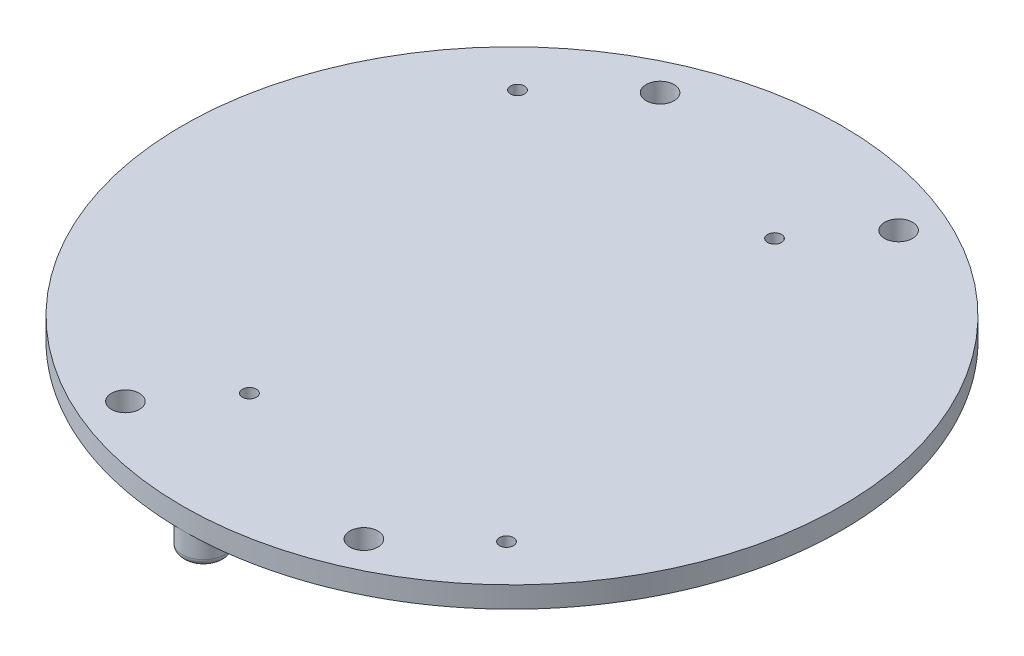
ISO-10303-21;
HEADER;
FILE_DESCRIPTION(('STEP AP214'),'2;1');
FILE_NAME('part.step','',(''),(''),'','','');
FILE_SCHEMA(('AUTOMOTIVE_DESIGN { 1 0 10303 214 1 1 1 1 }'));
ENDSEC;
DATA;
#1=APPLICATION_CONTEXT('core data for automotive mechanical design processes');
#2=APPLICATION_PROTOCOL_DEFINITION('international standard','automotive_design',2000,#1);
#3=PRODUCT_CONTEXT('',#1,'mechanical');
#4=PRODUCT('Part','Part','',(#3));
#5=PRODUCT_RELATED_PRODUCT_CATEGORY('part','',(#4));
#6=PRODUCT_DEFINITION_FORMATION('','',#4);
#7=PRODUCT_DEFINITION_CONTEXT('part definition',#1,'design');
#8=PRODUCT_DEFINITION('design','',#6,#7);
#9=PRODUCT_DEFINITION_SHAPE('','',#8);
#10=(LENGTH_UNIT() NAMED_UNIT(*) SI_UNIT(.MILLI.,.METRE.));
#11=(NAMED_UNIT(*) PLANE_ANGLE_UNIT() SI_UNIT($,.RADIAN.));
#12=(NAMED_UNIT(*) SI_UNIT($,.STERADIAN.) SOLID_ANGLE_UNIT());
#13=UNCERTAINTY_MEASURE_WITH_UNIT(LENGTH_MEASURE(1.E-05),#10,'distance_accuracy_value','');
#14=(GEOMETRIC_REPRESENTATION_CONTEXT(3) GLOBAL_UNCERTAINTY_ASSIGNED_CONTEXT((#13)) GLOBAL_UNIT_ASSIGNED_CONTEXT((#10,
#11,#12)) REPRESENTATION_CONTEXT('',''));
#15=CARTESIAN_POINT('',(0.,0.,0.));
#16=DIRECTION('',(0.,0.,1.));
#17=DIRECTION('',(1.,0.,0.));
#18=AXIS2_PLACEMENT_3D('',#15,#16,#17);
#19=CARTESIAN_POINT('',(0.,-1.5,0.));
#20=DIRECTION('',(0.,1.,0.));
#21=DIRECTION('',(0.,0.,1.));
#22=AXIS2_PLACEMENT_3D('',#19,#20,#21);
#23=PLANE('',#22);
#24=CARTESIAN_POINT('',(-17.009259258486,-1.5,-38.1280421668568));
#25=DIRECTION('',(0.,1.,0.));
#26=DIRECTION('',(0.,0.,1.));
#27=AXIS2_PLACEMENT_3D('',#24,#25,#26);
#28=CIRCLE('',#27,2.);
#29=CARTESIAN_POINT('',(-17.009259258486,-1.5,-36.1280421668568));
#30=VERTEX_POINT('',#29);
#31=EDGE_CURVE('E1192',#30,#30,#28,.T.);
#32=ORIENTED_EDGE('',*,*,#31,.T.);
#33=EDGE_LOOP('',(#32));
#34=FACE_BOUND('',#33,.T.);
#35=CARTESIAN_POINT('',(-17.0092592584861,-1.5,38.1280421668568));
#36=DIRECTION('',(0.,1.,0.));
#37=DIRECTION('',(0.,0.,-1.));
#38=AXIS2_PLACEMENT_3D('',#35,#36,#37);
#39=CIRCLE('',#38,2.);
#40=CARTESIAN_POINT('',(-17.0092592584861,-1.5,36.1280421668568));
#41=VERTEX_POINT('',#40);
#42=EDGE_CURVE('E1186',#41,#41,#39,.T.);
#43=ORIENTED_EDGE('',*,*,#42,.T.);
#44=EDGE_LOOP('',(#43));
#45=FACE_BOUND('',#44,.T.);
#46=CARTESIAN_POINT('',(17.009259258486,-1.5,-38.1280421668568));
#47=DIRECTION('',(0.,1.,0.));
#48=DIRECTION('',(0.,0.,-1.));
#49=AXIS2_PLACEMENT_3D('',#46,#47,#48);
#50=CIRCLE('',#49,2.);
#51=CARTESIAN_POINT('',(17.009259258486,-1.5,-40.1280421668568));
#52=VERTEX_POINT('',#51);
#53=EDGE_CURVE('E1198',#52,#52,#50,.T.);
#54=ORIENTED_EDGE('',*,*,#53,.T.);
#55=EDGE_LOOP('',(#54));
#56=FACE_BOUND('',#55,.T.);
#57=CARTESIAN_POINT('',(17.0092592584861,-1.5,38.1280421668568));
#58=DIRECTION('',(0.,1.,0.));
#59=DIRECTION('',(0.,0.,1.));
#60=AXIS2_PLACEMENT_3D('',#57,#58,#59);
#61=CIRCLE('',#60,2.);
#62=CARTESIAN_POINT('',(17.0092592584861,-1.5,40.1280421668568));
#63=VERTEX_POINT('',#62);
#64=EDGE_CURVE('E1204',#63,#63,#61,.T.);
#65=ORIENTED_EDGE('',*,*,#64,.T.);
#66=EDGE_LOOP('',(#65));
#67=FACE_BOUND('',#66,.T.);
#68=CARTESIAN_POINT('',(-9.16666666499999,-1.5,28.2842712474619));
#69=DIRECTION('',(0.,1.,0.));
#70=DIRECTION('',(0.,0.,1.));
#71=AXIS2_PLACEMENT_3D('',#68,#69,#70);
#72=CIRCLE('',#71,1.);
#73=CARTESIAN_POINT('',(-9.16666666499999,-1.5,29.2842712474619));
#74=VERTEX_POINT('',#73);
#75=EDGE_CURVE('E1216',#74,#74,#72,.T.);
#76=ORIENTED_EDGE('',*,*,#75,.T.);
#77=EDGE_LOOP('',(#76));
#78=FACE_BOUND('',#77,.T.);
#79=CARTESIAN_POINT('',(9.16666666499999,-1.5,-28.2842712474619));
#80=DIRECTION('',(0.,1.,0.));
#81=DIRECTION('',(0.,0.,1.));
#82=AXIS2_PLACEMENT_3D('',#79,#80,#81);
#83=CIRCLE('',#82,1.);
#84=CARTESIAN_POINT('',(9.16666666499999,-1.5,-27.2842712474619));
#85=VERTEX_POINT('',#84);
#86=EDGE_CURVE('E1222',#85,#85,#83,.T.);
#87=ORIENTED_EDGE('',*,*,#86,.T.);
#88=EDGE_LOOP('',(#87));
#89=FACE_BOUND('',#88,.T.);
#90=CARTESIAN_POINT('',(27.4999999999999,-1.5,28.2842712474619));
#91=DIRECTION('',(0.,1.,0.));
#92=DIRECTION('',(0.,0.,1.));
#93=AXIS2_PLACEMENT_3D('',#90,#91,#92);
#94=CIRCLE('',#93,0.999999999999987);
#95=CARTESIAN_POINT('',(27.4999999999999,-1.5,29.2842712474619));
#96=VERTEX_POINT('',#95);
#97=EDGE_CURVE('E364',#96,#96,#94,.T.);
#98=ORIENTED_EDGE('',*,*,#97,.T.);
#99=EDGE_LOOP('',(#98));
#100=FACE_BOUND('',#99,.T.);
#101=CARTESIAN_POINT('',(-27.4999999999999,-1.5,-28.2842712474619));
#102=DIRECTION('',(0.,1.,0.));
#103=DIRECTION('',(0.,0.,1.));
#104=AXIS2_PLACEMENT_3D('',#101,#102,#103);
#105=CIRCLE('',#104,1.);
#106=CARTESIAN_POINT('',(-27.4999999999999,-1.5,-27.2842712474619));
#107=VERTEX_POINT('',#106);
#108=EDGE_CURVE('E1210',#107,#107,#105,.T.);
#109=ORIENTED_EDGE('',*,*,#108,.T.);
#110=EDGE_LOOP('',(#109));
#111=FACE_BOUND('',#110,.T.);
#112=CARTESIAN_POINT('',(0.,-1.5,0.));
#113=DIRECTION('',(0.,1.,0.));
#114=DIRECTION('',(0.,0.,1.));
#115=AXIS2_PLACEMENT_3D('',#112,#113,#114);
#116=CIRCLE('',#115,47.);
#117=CARTESIAN_POINT('',(0.,-1.5,-47.));
#118=VERTEX_POINT('',#117);
#119=CARTESIAN_POINT('',(-46.7520897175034,-1.5,-4.82100684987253));
#120=VERTEX_POINT('',#119);
#121=EDGE_CURVE('E351',#118,#120,#116,.T.);
#122=ORIENTED_EDGE('',*,*,#121,.F.);
#123=CARTESIAN_POINT('',(0.,-1.5,-44.));
#124=DIRECTION('',(0.,-1.,0.));
#125=DIRECTION('',(0.,0.,1.));
#126=AXIS2_PLACEMENT_3D('',#123,#124,#125);
#127=CIRCLE('',#126,3.);
#128=EDGE_CURVE('E360',#118,#118,#127,.T.);
#129=ORIENTED_EDGE('',*,*,#128,.F.);
#130=CARTESIAN_POINT('',(0.,-1.5,47.));
#131=VERTEX_POINT('',#130);
#132=EDGE_CURVE('E347',#131,#118,#116,.T.);
#133=ORIENTED_EDGE('',*,*,#132,.F.);
#134=CARTESIAN_POINT('',(0.,-1.5,44.));
#135=DIRECTION('',(0.,-1.,0.));
#136=DIRECTION('',(0.,0.,-1.));
#137=AXIS2_PLACEMENT_3D('',#134,#135,#136);
#138=CIRCLE('',#137,3.);
#139=EDGE_CURVE('E956',#131,#131,#138,.T.);
#140=ORIENTED_EDGE('',*,*,#139,.F.);
#141=CARTESIAN_POINT('',(-35.0365559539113,-1.5,31.3279387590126));
#142=VERTEX_POINT('',#141);
#143=EDGE_CURVE('E354',#142,#131,#116,.T.);
#144=ORIENTED_EDGE('',*,*,#143,.F.);
#145=DIRECTION('',(-0.951288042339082,0.,0.308303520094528));
#146=VECTOR('',#145,1.);
#147=CARTESIAN_POINT('',(5.85776688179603,-1.5,18.0744728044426));
#148=LINE('',#147,#146);
#149=CARTESIAN_POINT('',(1.10132667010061,-1.5,19.6159904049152));
#150=VERTEX_POINT('',#149);
#151=EDGE_CURVE('E848',#150,#142,#148,.T.);
#152=ORIENTED_EDGE('',*,*,#151,.F.);
#153=DIRECTION('',(-0.308303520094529,0.,-0.951288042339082));
#154=VECTOR('',#153,1.);
#155=CARTESIAN_POINT('',(-4.75644021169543,-1.5,1.54151760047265));
#156=LINE('',#155,#154);
#157=CARTESIAN_POINT('',(0.176416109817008,-1.5,16.7621262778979));
#158=VERTEX_POINT('',#157);
#159=EDGE_CURVE('E845',#150,#158,#156,.T.);
#160=ORIENTED_EDGE('',*,*,#159,.T.);
#161=DIRECTION('',(-0.951288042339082,0.,0.308303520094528));
#162=VECTOR('',#161,1.);
#163=CARTESIAN_POINT('',(4.93285632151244,-1.5,15.2206086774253));
#164=LINE('',#163,#162);
#165=CARTESIAN_POINT('',(-7.43388822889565,-1.5,19.2285544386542));
#166=VERTEX_POINT('',#165);
#167=EDGE_CURVE('E843',#158,#166,#164,.T.);
#168=ORIENTED_EDGE('',*,*,#167,.T.);
#169=DIRECTION('',(-0.308303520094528,0.,-0.951288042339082));
#170=VECTOR('',#169,1.);
#171=CARTESIAN_POINT('',(-12.3667445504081,-1.5,4.00794576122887));
#172=LINE('',#171,#170);
#173=CARTESIAN_POINT('',(-9.90031638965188,-1.5,11.6182500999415));
#174=VERTEX_POINT('',#173);
#175=EDGE_CURVE('E840',#166,#174,#172,.T.);
#176=ORIENTED_EDGE('',*,*,#175,.T.);
#177=DIRECTION('',(-0.951288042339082,0.,0.308303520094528));
#178=VECTOR('',#177,1.);
#179=CARTESIAN_POINT('',(14.8331727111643,-1.5,3.60235857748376));
#180=LINE('',#179,#178);
#181=CARTESIAN_POINT('',(13.8818846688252,-1.5,3.91066209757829));
#182=VERTEX_POINT('',#181);
#183=EDGE_CURVE('E611',#182,#174,#180,.T.);
#184=ORIENTED_EDGE('',*,*,#183,.F.);
#185=CARTESIAN_POINT('',(13.5735811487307,-1.5,2.9593740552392));
#186=DIRECTION('',(0.,1.,0.));
#187=DIRECTION('',(0.,0.,1.));
#188=AXIS2_PLACEMENT_3D('',#185,#186,#187);
#189=CIRCLE('',#188,1.);
#190=CARTESIAN_POINT('',(14.5248691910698,-1.5,2.65107053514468));
#191=VERTEX_POINT('',#190);
#192=EDGE_CURVE('E50',#182,#191,#189,.T.);
#193=ORIENTED_EDGE('',*,*,#192,.T.);
#194=DIRECTION('',(0.308303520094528,0.,0.951288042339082));
#195=VECTOR('',#194,1.);
#196=CARTESIAN_POINT('',(9.90031638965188,-1.5,-11.6182500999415));
#197=LINE('',#196,#195);
#198=CARTESIAN_POINT('',(10.2086199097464,-1.5,-10.6669620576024));
#199=VERTEX_POINT('',#198);
#200=EDGE_CURVE('E588',#199,#191,#197,.T.);
#201=ORIENTED_EDGE('',*,*,#200,.F.);
#202=CARTESIAN_POINT('',(9.25733186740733,-1.5,-10.3586585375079));
#203=DIRECTION('',(0.,1.,0.));
#204=DIRECTION('',(0.,0.,1.));
#205=AXIS2_PLACEMENT_3D('',#202,#203,#204);
#206=CIRCLE('',#205,1.);
#207=CARTESIAN_POINT('',(8.94902834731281,-1.5,-11.309946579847));
#208=VERTEX_POINT('',#207);
#209=EDGE_CURVE('E58',#199,#208,#206,.T.);
#210=ORIENTED_EDGE('',*,*,#209,.T.);
#211=DIRECTION('',(0.951288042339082,0.,-0.308303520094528));
#212=VECTOR('',#211,1.);
#213=CARTESIAN_POINT('',(-14.8331727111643,-1.5,-3.60235857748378));
#214=LINE('',#213,#212);
#215=CARTESIAN_POINT('',(-14.8331727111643,-1.5,-3.60235857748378));
#216=VERTEX_POINT('',#215);
#217=EDGE_CURVE('E603',#216,#208,#214,.T.);
#218=ORIENTED_EDGE('',*,*,#217,.F.);
#219=CARTESIAN_POINT('',(-17.2996008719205,-1.5,-11.2126629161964));
#220=VERTEX_POINT('',#219);
#221=EDGE_CURVE('E839',#216,#220,#172,.T.);
#222=ORIENTED_EDGE('',*,*,#221,.T.);
#223=DIRECTION('',(-0.951288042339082,0.,0.308303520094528));
#224=VECTOR('',#223,1.);
#225=CARTESIAN_POINT('',(-4.93285632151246,-1.5,-15.2206086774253));
#226=LINE('',#225,#224);
#227=CARTESIAN_POINT('',(-9.68929653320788,-1.5,-13.6790910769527));
#228=VERTEX_POINT('',#227);
#229=EDGE_CURVE('E836',#228,#220,#226,.T.);
#230=ORIENTED_EDGE('',*,*,#229,.F.);
#231=DIRECTION('',(0.308303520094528,0.,0.951288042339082));
#232=VECTOR('',#231,1.);
#233=CARTESIAN_POINT('',(-4.75644021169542,-1.5,1.54151760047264));
#234=LINE('',#233,#232);
#235=CARTESIAN_POINT('',(-10.6142070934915,-1.5,-16.5329552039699));
#236=VERTEX_POINT('',#235);
#237=EDGE_CURVE('E386',#236,#228,#234,.T.);
#238=ORIENTED_EDGE('',*,*,#237,.F.);
#239=DIRECTION('',(-0.951288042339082,0.,0.308303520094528));
#240=VECTOR('',#239,1.);
#241=CARTESIAN_POINT('',(-5.85776688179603,-1.5,-18.0744728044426));
#242=LINE('',#241,#240);
#243=EDGE_CURVE('E363',#236,#120,#242,.T.);
#244=ORIENTED_EDGE('',*,*,#243,.T.);
#245=EDGE_LOOP('',(#122,#129,#133,#140,#144,#152,#160,#168,#176,#184,#193,#201,#210,#218,#222,
#230,#238,#244));
#246=FACE_BOUND('',#245,.T.);
#247=ADVANCED_FACE('F35',(#34,#45,#56,#67,#78,#89,#100,#111,#246),#23,.F.);
#248=CARTESIAN_POINT('',(0.,-9.5,0.));
#249=DIRECTION('',(0.,-1.,0.));
#250=DIRECTION('',(0.,0.,-1.));
#251=AXIS2_PLACEMENT_3D('',#248,#249,#250);
#252=PLANE('',#251);
#253=DIRECTION('',(0.308303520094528,0.,0.951288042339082));
#254=VECTOR('',#253,1.);
#255=CARTESIAN_POINT('',(-34.246369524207,-9.5,11.098926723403));
#256=LINE('',#255,#254);
#257=CARTESIAN_POINT('',(-39.1792258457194,-9.5,-4.12168195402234));
#258=VERTEX_POINT('',#257);
#259=CARTESIAN_POINT('',(-29.3135132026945,-9.5,26.3195354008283));
#260=VERTEX_POINT('',#259);
#261=EDGE_CURVE('E807',#258,#260,#256,.T.);
#262=ORIENTED_EDGE('',*,*,#261,.F.);
#263=DIRECTION('',(-0.951288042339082,0.,0.308303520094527));
#264=VECTOR('',#263,1.);
#265=CARTESIAN_POINT('',(-39.1792258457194,-9.5,-4.12168195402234));
#266=LINE('',#265,#264);
#267=CARTESIAN_POINT('',(-36.3253617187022,-9.5,-5.04659251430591));
#268=VERTEX_POINT('',#267);
#269=EDGE_CURVE('E814',#268,#258,#266,.T.);
#270=ORIENTED_EDGE('',*,*,#269,.F.);
#271=DIRECTION('',(-0.308303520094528,0.,-0.951288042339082));
#272=VECTOR('',#271,1.);
#273=CARTESIAN_POINT('',(-31.3925053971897,-9.5,10.1740161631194));
#274=LINE('',#273,#272);
#275=CARTESIAN_POINT('',(-26.4596490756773,-9.5,25.3946248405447));
#276=VERTEX_POINT('',#275);
#277=EDGE_CURVE('E822',#276,#268,#274,.T.);
#278=ORIENTED_EDGE('',*,*,#277,.F.);
#279=DIRECTION('',(0.951288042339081,0.,-0.308303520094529));
#280=VECTOR('',#279,1.);
#281=CARTESIAN_POINT('',(-29.3135132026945,-9.5,26.3195354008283));
#282=LINE('',#281,#280);
#283=EDGE_CURVE('E527',#260,#276,#282,.T.);
#284=ORIENTED_EDGE('',*,*,#283,.F.);
#285=EDGE_LOOP('',(#262,#270,#278,#284));
#286=FACE_BOUND('',#285,.T.);
#287=ADVANCED_FACE('F665',(#286),#252,.T.);
#288=DIRECTION('',(0.308303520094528,0.,0.951288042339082));
#289=VECTOR('',#288,1.);
#290=CARTESIAN_POINT('',(-15.2206086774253,-9.5,4.93285632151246));
#291=LINE('',#290,#289);
#292=CARTESIAN_POINT('',(-20.1534649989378,-9.5,-10.2877523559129));
#293=VERTEX_POINT('',#292);
#294=CARTESIAN_POINT('',(-10.2877523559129,-9.5,20.1534649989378));
#295=VERTEX_POINT('',#294);
#296=EDGE_CURVE('E916',#293,#295,#291,.T.);
#297=ORIENTED_EDGE('',*,*,#296,.F.);
#298=CARTESIAN_POINT('',(-17.2996008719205,-9.5,-11.2126629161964));
#299=VERTEX_POINT('',#298);
#300=EDGE_CURVE('E950',#299,#293,#266,.T.);
#301=ORIENTED_EDGE('',*,*,#300,.F.);
#302=DIRECTION('',(-0.308303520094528,0.,-0.951288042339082));
#303=VECTOR('',#302,1.);
#304=CARTESIAN_POINT('',(-12.3667445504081,-9.5,4.00794576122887));
#305=LINE('',#304,#303);
#306=CARTESIAN_POINT('',(-7.43388822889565,-9.5,19.2285544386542));
#307=VERTEX_POINT('',#306);
#308=EDGE_CURVE('E817',#307,#299,#305,.T.);
#309=ORIENTED_EDGE('',*,*,#308,.F.);
#310=EDGE_CURVE('E521',#295,#307,#282,.T.);
#311=ORIENTED_EDGE('',*,*,#310,.F.);
#312=EDGE_LOOP('',(#297,#301,#309,#311));
#313=FACE_BOUND('',#312,.T.);
#314=ADVANCED_FACE('F668',(#313),#252,.T.);
#315=CARTESIAN_POINT('',(-12.3667445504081,-9.5,4.00794576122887));
#316=DIRECTION('',(0.951288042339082,0.,-0.308303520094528));
#317=DIRECTION('',(-0.308303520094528,0.,-0.951288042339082));
#318=AXIS2_PLACEMENT_3D('',#315,#316,#317);
#319=PLANE('',#318);
#320=DIRECTION('',(0.308303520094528,0.,0.951288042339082));
#321=VECTOR('',#320,1.);
#322=CARTESIAN_POINT('',(-20.9158222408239,-3.5,-22.3707195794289));
#323=LINE('',#322,#321);
#324=CARTESIAN_POINT('',(-14.8331727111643,-3.5,-3.60235857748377));
#325=VERTEX_POINT('',#324);
#326=CARTESIAN_POINT('',(-9.90031638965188,-3.5,11.6182500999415));
#327=VERTEX_POINT('',#326);
#328=EDGE_CURVE('E558',#325,#327,#323,.T.);
#329=ORIENTED_EDGE('',*,*,#328,.T.);
#330=DIRECTION('',(0.,1.,0.));
#331=VECTOR('',#330,1.);
#332=CARTESIAN_POINT('',(-9.90031638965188,-6.5,11.6182500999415));
#333=LINE('',#332,#331);
#334=EDGE_CURVE('E616',#327,#174,#333,.T.);
#335=ORIENTED_EDGE('',*,*,#334,.T.);
#336=ORIENTED_EDGE('',*,*,#175,.F.);
#337=DIRECTION('',(0.,1.,0.));
#338=VECTOR('',#337,1.);
#339=CARTESIAN_POINT('',(-7.43388822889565,-9.5,19.2285544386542));
#340=LINE('',#339,#338);
#341=EDGE_CURVE('E945',#307,#166,#340,.T.);
#342=ORIENTED_EDGE('',*,*,#341,.F.);
#343=ORIENTED_EDGE('',*,*,#308,.T.);
#344=DIRECTION('',(0.,1.,0.));
#345=VECTOR('',#344,1.);
#346=CARTESIAN_POINT('',(-17.2996008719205,-9.5,-11.2126629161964));
#347=LINE('',#346,#345);
#348=EDGE_CURVE('E943',#299,#220,#347,.T.);
#349=ORIENTED_EDGE('',*,*,#348,.T.);
#350=ORIENTED_EDGE('',*,*,#221,.F.);
#351=DIRECTION('',(0.,1.,0.));
#352=VECTOR('',#351,1.);
#353=CARTESIAN_POINT('',(-14.8331727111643,-6.5,-3.60235857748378));
#354=LINE('',#353,#352);
#355=EDGE_CURVE('E609',#325,#216,#354,.T.);
#356=ORIENTED_EDGE('',*,*,#355,.F.);
#357=EDGE_LOOP('',(#329,#335,#336,#342,#343,#349,#350,#356));
#358=FACE_BOUND('',#357,.T.);
#359=ADVANCED_FACE('F692',(#358),#319,.T.);
#360=CARTESIAN_POINT('',(-46.9506840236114,-1.5,-2.15250312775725));
#361=VERTEX_POINT('',#360);
#362=CARTESIAN_POINT('',(-36.7626637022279,-1.5,29.2832128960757));
#363=VERTEX_POINT('',#362);
#364=EDGE_CURVE('E379',#361,#363,#116,.T.);
#365=ORIENTED_EDGE('',*,*,#364,.F.);
#366=DIRECTION('',(0.308303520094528,0.,0.951288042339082));
#367=VECTOR('',#366,1.);
#368=CARTESIAN_POINT('',(-60.1084996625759,-1.5,-42.7516914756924));
#369=LINE('',#368,#367);
#370=CARTESIAN_POINT('',(-46.7895301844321,-1.5,-1.65525379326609));
#371=VERTEX_POINT('',#370);
#372=EDGE_CURVE('E624',#361,#371,#369,.T.);
#373=ORIENTED_EDGE('',*,*,#372,.T.);
#374=DIRECTION('',(-0.951288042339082,0.,0.308303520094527));
#375=VECTOR('',#374,1.);
#376=CARTESIAN_POINT('',(-4.93285632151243,-1.5,-15.2206086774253));
#377=LINE('',#376,#375);
#378=CARTESIAN_POINT('',(-39.1792258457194,-1.5,-4.12168195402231));
#379=VERTEX_POINT('',#378);
#380=EDGE_CURVE('E392',#379,#371,#377,.T.);
#381=ORIENTED_EDGE('',*,*,#380,.F.);
#382=DIRECTION('',(0.308303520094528,0.,0.951288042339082));
#383=VECTOR('',#382,1.);
#384=CARTESIAN_POINT('',(-34.246369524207,-1.5,11.098926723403));
#385=LINE('',#384,#383);
#386=CARTESIAN_POINT('',(-29.3135132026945,-1.5,26.3195354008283));
#387=VERTEX_POINT('',#386);
#388=EDGE_CURVE('E809',#379,#387,#385,.T.);
#389=ORIENTED_EDGE('',*,*,#388,.T.);
#390=DIRECTION('',(-0.951288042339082,0.,0.308303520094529));
#391=VECTOR('',#390,1.);
#392=CARTESIAN_POINT('',(4.93285632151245,-1.5,15.2206086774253));
#393=LINE('',#392,#391);
#394=CARTESIAN_POINT('',(-36.9238175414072,-1.5,28.7859635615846));
#395=VERTEX_POINT('',#394);
#396=EDGE_CURVE('E854',#387,#395,#393,.T.);
#397=ORIENTED_EDGE('',*,*,#396,.T.);
#398=EDGE_CURVE('E621',#395,#363,#369,.T.);
#399=ORIENTED_EDGE('',*,*,#398,.T.);
#400=EDGE_LOOP('',(#365,#373,#381,#389,#397,#399));
#401=FACE_BOUND('',#400,.T.);
#402=ADVANCED_FACE('F695',(#401),#23,.F.);
#403=CARTESIAN_POINT('',(0.,1.5,0.));
#404=DIRECTION('',(0.,-1.,0.));
#405=DIRECTION('',(0.,0.,-1.));
#406=AXIS2_PLACEMENT_3D('',#403,#404,#405);
#407=CYLINDRICAL_SURFACE('',#406,47.);
#408=CARTESIAN_POINT('',(0.,1.5,0.));
#409=DIRECTION('',(0.,1.,0.));
#410=DIRECTION('',(0.,0.,1.));
#411=AXIS2_PLACEMENT_3D('',#408,#409,#410);
#412=CIRCLE('',#411,47.);
#413=CARTESIAN_POINT('',(0.,1.5,47.));
#414=VERTEX_POINT('',#413);
#415=EDGE_CURVE('E377',#414,#414,#412,.T.);
#416=ORIENTED_EDGE('',*,*,#415,.F.);
#417=EDGE_LOOP('',(#416));
#418=FACE_BOUND('',#417,.T.);
#419=ORIENTED_EDGE('',*,*,#364,.T.);
#420=CARTESIAN_POINT('',(-36.7626637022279,-1.5,29.2832128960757));
#421=CARTESIAN_POINT('',(-36.6236327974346,-1.50000236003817,29.4577554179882));
#422=CARTESIAN_POINT('',(-36.4833562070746,-1.50115389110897,29.6313097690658));
#423=CARTESIAN_POINT('',(-36.2004160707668,-1.50603438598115,29.9763176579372));
#424=CARTESIAN_POINT('',(-36.0577534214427,-1.50976240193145,30.1477719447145));
#425=CARTESIAN_POINT('',(-35.7700420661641,-1.52007459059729,30.4885850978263));
#426=CARTESIAN_POINT('',(-35.624993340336,-1.5266587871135,30.6579439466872));
#427=CARTESIAN_POINT('',(-35.3325243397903,-1.54299011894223,30.9945554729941));
#428=CARTESIAN_POINT('',(-35.1851032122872,-1.55273841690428,31.1618073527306));
#429=CARTESIAN_POINT('',(-35.0365559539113,-1.56421989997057,31.3279387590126));
#430=B_SPLINE_CURVE_WITH_KNOTS('',3,(#420,#421,#422,#423,#424,#425,#426,#427,#428,#429),
.UNSPECIFIED.,.F.,.F.,(4,2,2,2,4),(0.,0.669437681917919,1.3386292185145,2.00782633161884,
2.67726962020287),.UNSPECIFIED.);
#431=CARTESIAN_POINT('',(-35.0365559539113,-1.56421989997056,31.3279387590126));
#432=VERTEX_POINT('',#431);
#433=EDGE_CURVE('E642',#363,#432,#430,.T.);
#434=ORIENTED_EDGE('',*,*,#433,.T.);
#435=DIRECTION('',(0.,1.,0.));
#436=VECTOR('',#435,1.);
#437=CARTESIAN_POINT('',(-35.0365559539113,-9.5,31.3279387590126));
#438=LINE('',#437,#436);
#439=EDGE_CURVE('E401',#432,#142,#438,.T.);
#440=ORIENTED_EDGE('',*,*,#439,.T.);
#441=ORIENTED_EDGE('',*,*,#143,.T.);
#442=ORIENTED_EDGE('',*,*,#132,.T.);
#443=ORIENTED_EDGE('',*,*,#121,.T.);
#444=DIRECTION('',(0.,1.,0.));
#445=VECTOR('',#444,1.);
#446=CARTESIAN_POINT('',(-46.7520897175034,-9.5,-4.82100684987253));
#447=LINE('',#446,#445);
#448=CARTESIAN_POINT('',(-46.7520897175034,-1.56421989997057,-4.82100684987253));
#449=VERTEX_POINT('',#448);
#450=EDGE_CURVE('E396',#449,#120,#447,.T.);
#451=ORIENTED_EDGE('',*,*,#450,.F.);
#452=CARTESIAN_POINT('',(-43.5620347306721,-9.5,-17.6450879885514));
#453=CARTESIAN_POINT('',(-43.5620041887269,-9.33411921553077,-17.645141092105));
#454=CARTESIAN_POINT('',(-43.5650463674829,-9.16826638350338,-17.6376524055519));
#455=CARTESIAN_POINT('',(-43.5770475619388,-8.83822102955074,-17.6079922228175));
#456=CARTESIAN_POINT('',(-43.5860019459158,-8.67402731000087,-17.5858322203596));
#457=CARTESIAN_POINT('',(-43.6094953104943,-8.35007845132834,-17.5274880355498));
#458=CARTESIAN_POINT('',(-43.6239842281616,-8.19029690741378,-17.4914295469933));
#459=CARTESIAN_POINT('',(-43.6581519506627,-7.87490456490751,-17.4059729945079));
#460=CARTESIAN_POINT('',(-43.6778314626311,-7.7192943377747,-17.356573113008));
#461=CARTESIAN_POINT('',(-43.7218200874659,-7.41378567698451,-17.2454630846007));
#462=CARTESIAN_POINT('',(-43.7461144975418,-7.26387087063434,-17.1837920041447));
#463=CARTESIAN_POINT('',(-43.7988226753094,-6.97000064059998,-17.0489989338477));
#464=CARTESIAN_POINT('',(-43.8272381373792,-6.826047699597,-16.9758722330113));
#465=CARTESIAN_POINT('',(-43.9178878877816,-6.40365243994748,-16.7405921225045));
#466=CARTESIAN_POINT('',(-43.9854702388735,-6.13504210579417,-16.5626762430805));
#467=CARTESIAN_POINT('',(-44.159613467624,-5.52349880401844,-16.0938824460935));
#468=CARTESIAN_POINT('',(-44.270863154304,-5.19463554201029,-15.7864618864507));
#469=CARTESIAN_POINT('',(-44.4437605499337,-4.74363401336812,-15.2899780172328));
#470=CARTESIAN_POINT('',(-44.5024763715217,-4.60019164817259,-15.1183472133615));
#471=CARTESIAN_POINT('',(-44.6209370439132,-4.32671000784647,-14.7650458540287));
#472=CARTESIAN_POINT('',(-44.6806817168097,-4.19666844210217,-14.5833770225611));
#473=CARTESIAN_POINT('',(-44.8325278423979,-3.88265038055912,-14.1115056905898));
#474=CARTESIAN_POINT('',(-44.9247223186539,-3.70735638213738,-13.8155554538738));
#475=CARTESIAN_POINT('',(-45.1069342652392,-3.3838915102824,-13.2085229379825));
#476=CARTESIAN_POINT('',(-45.1969504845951,-3.2357359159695,-12.8974322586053));
#477=CARTESIAN_POINT('',(-45.3731167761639,-2.96345656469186,-12.2633093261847));
#478=CARTESIAN_POINT('',(-45.4592604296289,-2.83937165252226,-11.9402587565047));
#479=CARTESIAN_POINT('',(-45.626266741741,-2.61268712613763,-11.2853034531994));
#480=CARTESIAN_POINT('',(-45.7071274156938,-2.51009555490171,-10.9533954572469));
#481=CARTESIAN_POINT('',(-45.8544625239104,-2.33366578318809,-10.3181004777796));
#482=CARTESIAN_POINT('',(-45.9215562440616,-2.25794016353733,-10.0153745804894));
#483=CARTESIAN_POINT('',(-46.0502806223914,-2.12004685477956,-9.40577943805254));
#484=CARTESIAN_POINT('',(-46.1119121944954,-2.05787689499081,-9.0989108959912));
#485=CARTESIAN_POINT('',(-46.2294330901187,-1.94552833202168,-8.48164515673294));
#486=CARTESIAN_POINT('',(-46.2853176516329,-1.89535962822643,-8.17124526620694));
#487=CARTESIAN_POINT('',(-46.3910516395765,-1.8057191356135,-7.54786969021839));
#488=CARTESIAN_POINT('',(-46.4409003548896,-1.76624860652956,-7.23489370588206));
#489=CARTESIAN_POINT('',(-46.581137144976,-1.66199558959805,-6.29289461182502));
#490=CARTESIAN_POINT('',(-46.6622006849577,-1.61138543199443,-5.66087988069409));
#491=CARTESIAN_POINT('',(-46.7986022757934,-1.53940433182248,-4.39289104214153));
#492=CARTESIAN_POINT('',(-46.8539529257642,-1.51801905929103,-3.75691902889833));
#493=CARTESIAN_POINT('',(-46.9070569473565,-1.50503664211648,-2.95874247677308));
#494=CARTESIAN_POINT('',(-46.9169547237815,-1.50312047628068,-2.79740924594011));
#495=CARTESIAN_POINT('',(-46.9350711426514,-1.50060296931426,-2.47489962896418));
#496=CARTESIAN_POINT('',(-46.943292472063,-1.49999950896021,-2.3137234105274));
#497=CARTESIAN_POINT('',(-46.9506840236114,-1.5,-2.15250312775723));
#498=B_SPLINE_CURVE_WITH_KNOTS('',3,(#452,#453,#454,#455,#456,#457,#458,#459,#460,#461,#462,
#463,#464,#465,#466,#467,#468,#469,#470,#471,#472,#473,#474,#475,#476,#477,#478,#479,#480,#481,
#482,#483,#484,#485,#486,#487,#488,#489,#490,#491,#492,#493,#494,#495,#496,#497),.UNSPECIFIED.,
.F.,.F.,(4,2,2,2,2,2,2,2,2,2,2,2,2,2,2,2,2,2,2,2,2,2,4),(0.,0.49740151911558,0.994413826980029,
1.48703294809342,1.97971921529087,2.47086136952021,2.96220603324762,3.94607265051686,
5.32917035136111,6.02250801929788,6.71572697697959,7.78237882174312,8.84962936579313,
9.91858814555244,10.9879462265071,11.9451124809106,12.9021182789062,13.85991077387,
14.8178160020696,16.7338721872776,18.6489885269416,19.133925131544,19.6180782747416),.UNSPECIFIED.);
#499=EDGE_CURVE('E634',#449,#361,#498,.T.);
#500=ORIENTED_EDGE('',*,*,#499,.T.);
#501=EDGE_LOOP('',(#419,#434,#440,#441,#442,#443,#451,#500));
#502=FACE_BOUND('',#501,.T.);
#503=ADVANCED_FACE('F349',(#418,#502),#407,.T.);
#504=CARTESIAN_POINT('',(0.,1.5,0.));
#505=DIRECTION('',(0.,1.,0.));
#506=DIRECTION('',(0.,0.,1.));
#507=AXIS2_PLACEMENT_3D('',#504,#505,#506);
#508=PLANE('',#507);
#509=CARTESIAN_POINT('',(-17.0092592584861,1.5,38.1280421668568));
#510=DIRECTION('',(0.,1.,0.));
#511=DIRECTION('',(0.,0.,-1.));
#512=AXIS2_PLACEMENT_3D('',#509,#510,#511);
#513=CIRCLE('',#512,2.);
#514=CARTESIAN_POINT('',(-17.0092592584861,1.5,36.1280421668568));
#515=VERTEX_POINT('',#514);
#516=EDGE_CURVE('E944',#515,#515,#513,.T.);
#517=ORIENTED_EDGE('',*,*,#516,.F.);
#518=EDGE_LOOP('',(#517));
#519=FACE_BOUND('',#518,.T.);
#520=CARTESIAN_POINT('',(-17.009259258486,1.5,-38.1280421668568));
#521=DIRECTION('',(0.,1.,0.));
#522=DIRECTION('',(0.,0.,1.));
#523=AXIS2_PLACEMENT_3D('',#520,#521,#522);
#524=CIRCLE('',#523,2.);
#525=CARTESIAN_POINT('',(-17.009259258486,1.5,-36.1280421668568));
#526=VERTEX_POINT('',#525);
#527=EDGE_CURVE('E1189',#526,#526,#524,.T.);
#528=ORIENTED_EDGE('',*,*,#527,.F.);
#529=EDGE_LOOP('',(#528));
#530=FACE_BOUND('',#529,.T.);
#531=CARTESIAN_POINT('',(17.009259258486,1.5,-38.1280421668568));
#532=DIRECTION('',(0.,1.,0.));
#533=DIRECTION('',(0.,0.,-1.));
#534=AXIS2_PLACEMENT_3D('',#531,#532,#533);
#535=CIRCLE('',#534,2.);
#536=CARTESIAN_POINT('',(17.009259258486,1.5,-40.1280421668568));
#537=VERTEX_POINT('',#536);
#538=EDGE_CURVE('E1195',#537,#537,#535,.T.);
#539=ORIENTED_EDGE('',*,*,#538,.F.);
#540=EDGE_LOOP('',(#539));
#541=FACE_BOUND('',#540,.T.);
#542=CARTESIAN_POINT('',(17.0092592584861,1.5,38.1280421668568));
#543=DIRECTION('',(0.,1.,0.));
#544=DIRECTION('',(0.,0.,1.));
#545=AXIS2_PLACEMENT_3D('',#542,#543,#544);
#546=CIRCLE('',#545,2.);
#547=CARTESIAN_POINT('',(17.0092592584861,1.5,40.1280421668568));
#548=VERTEX_POINT('',#547);
#549=EDGE_CURVE('E1201',#548,#548,#546,.T.);
#550=ORIENTED_EDGE('',*,*,#549,.F.);
#551=EDGE_LOOP('',(#550));
#552=FACE_BOUND('',#551,.T.);
#553=CARTESIAN_POINT('',(-27.4999999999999,1.5,-28.2842712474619));
#554=DIRECTION('',(0.,1.,0.));
#555=DIRECTION('',(0.,0.,1.));
#556=AXIS2_PLACEMENT_3D('',#553,#554,#555);
#557=CIRCLE('',#556,1.);
#558=CARTESIAN_POINT('',(-27.4999999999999,1.5,-27.2842712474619));
#559=VERTEX_POINT('',#558);
#560=EDGE_CURVE('E1207',#559,#559,#557,.T.);
#561=ORIENTED_EDGE('',*,*,#560,.F.);
#562=EDGE_LOOP('',(#561));
#563=FACE_BOUND('',#562,.T.);
#564=CARTESIAN_POINT('',(-9.16666666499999,1.5,28.2842712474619));
#565=DIRECTION('',(0.,1.,0.));
#566=DIRECTION('',(0.,0.,1.));
#567=AXIS2_PLACEMENT_3D('',#564,#565,#566);
#568=CIRCLE('',#567,1.);
#569=CARTESIAN_POINT('',(-9.16666666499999,1.5,29.2842712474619));
#570=VERTEX_POINT('',#569);
#571=EDGE_CURVE('E1213',#570,#570,#568,.T.);
#572=ORIENTED_EDGE('',*,*,#571,.F.);
#573=EDGE_LOOP('',(#572));
#574=FACE_BOUND('',#573,.T.);
#575=CARTESIAN_POINT('',(9.16666666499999,1.5,-28.2842712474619));
#576=DIRECTION('',(0.,1.,0.));
#577=DIRECTION('',(0.,0.,1.));
#578=AXIS2_PLACEMENT_3D('',#575,#576,#577);
#579=CIRCLE('',#578,1.);
#580=CARTESIAN_POINT('',(9.16666666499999,1.5,-27.2842712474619));
#581=VERTEX_POINT('',#580);
#582=EDGE_CURVE('E1219',#581,#581,#579,.T.);
#583=ORIENTED_EDGE('',*,*,#582,.F.);
#584=EDGE_LOOP('',(#583));
#585=FACE_BOUND('',#584,.T.);
#586=CARTESIAN_POINT('',(27.4999999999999,1.5,28.2842712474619));
#587=DIRECTION('',(0.,1.,0.));
#588=DIRECTION('',(0.,0.,1.));
#589=AXIS2_PLACEMENT_3D('',#586,#587,#588);
#590=CIRCLE('',#589,0.999999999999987);
#591=CARTESIAN_POINT('',(27.4999999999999,1.5,29.2842712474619));
#592=VERTEX_POINT('',#591);
#593=EDGE_CURVE('E367',#592,#592,#590,.T.);
#594=ORIENTED_EDGE('',*,*,#593,.F.);
#595=EDGE_LOOP('',(#594));
#596=FACE_BOUND('',#595,.T.);
#597=ORIENTED_EDGE('',*,*,#415,.T.);
#598=EDGE_LOOP('',(#597));
#599=FACE_BOUND('',#598,.T.);
#600=ADVANCED_FACE('F751',(#519,#530,#541,#552,#563,#574,#585,#596,#599),#508,.T.);
#601=CARTESIAN_POINT('',(27.4999999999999,-1.5,28.2842712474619));
#602=DIRECTION('',(0.,1.,0.));
#603=DIRECTION('',(0.,0.,1.));
#604=AXIS2_PLACEMENT_3D('',#601,#602,#603);
#605=CYLINDRICAL_SURFACE('',#604,0.999999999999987);
#606=ORIENTED_EDGE('',*,*,#97,.F.);
#607=EDGE_LOOP('',(#606));
#608=FACE_BOUND('',#607,.T.);
#609=ORIENTED_EDGE('',*,*,#593,.T.);
#610=EDGE_LOOP('',(#609));
#611=FACE_BOUND('',#610,.T.);
#612=ADVANCED_FACE('F747',(#608,#611),#605,.F.);
#613=CARTESIAN_POINT('',(9.16666666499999,-1.5,-28.2842712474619));
#614=DIRECTION('',(0.,1.,0.));
#615=DIRECTION('',(0.,0.,1.));
#616=AXIS2_PLACEMENT_3D('',#613,#614,#615);
#617=CYLINDRICAL_SURFACE('',#616,1.);
#618=ORIENTED_EDGE('',*,*,#86,.F.);
#619=EDGE_LOOP('',(#618));
#620=FACE_BOUND('',#619,.T.);
#621=ORIENTED_EDGE('',*,*,#582,.T.);
#622=EDGE_LOOP('',(#621));
#623=FACE_BOUND('',#622,.T.);
#624=ADVANCED_FACE('F743',(#620,#623),#617,.F.);
#625=CARTESIAN_POINT('',(-9.16666666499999,-1.5,28.2842712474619));
#626=DIRECTION('',(0.,1.,0.));
#627=DIRECTION('',(0.,0.,1.));
#628=AXIS2_PLACEMENT_3D('',#625,#626,#627);
#629=CYLINDRICAL_SURFACE('',#628,1.);
#630=ORIENTED_EDGE('',*,*,#75,.F.);
#631=EDGE_LOOP('',(#630));
#632=FACE_BOUND('',#631,.T.);
#633=ORIENTED_EDGE('',*,*,#571,.T.);
#634=EDGE_LOOP('',(#633));
#635=FACE_BOUND('',#634,.T.);
#636=ADVANCED_FACE('F739',(#632,#635),#629,.F.);
#637=CARTESIAN_POINT('',(-27.4999999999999,-1.5,-28.2842712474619));
#638=DIRECTION('',(0.,1.,0.));
#639=DIRECTION('',(0.,0.,1.));
#640=AXIS2_PLACEMENT_3D('',#637,#638,#639);
#641=CYLINDRICAL_SURFACE('',#640,1.);
#642=ORIENTED_EDGE('',*,*,#108,.F.);
#643=EDGE_LOOP('',(#642));
#644=FACE_BOUND('',#643,.T.);
#645=ORIENTED_EDGE('',*,*,#560,.T.);
#646=EDGE_LOOP('',(#645));
#647=FACE_BOUND('',#646,.T.);
#648=ADVANCED_FACE('F735',(#644,#647),#641,.F.);
#649=CARTESIAN_POINT('',(17.0092592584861,-1.5,38.1280421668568));
#650=DIRECTION('',(0.,1.,0.));
#651=DIRECTION('',(0.,0.,1.));
#652=AXIS2_PLACEMENT_3D('',#649,#650,#651);
#653=CYLINDRICAL_SURFACE('',#652,2.);
#654=ORIENTED_EDGE('',*,*,#64,.F.);
#655=EDGE_LOOP('',(#654));
#656=FACE_BOUND('',#655,.T.);
#657=ORIENTED_EDGE('',*,*,#549,.T.);
#658=EDGE_LOOP('',(#657));
#659=FACE_BOUND('',#658,.T.);
#660=ADVANCED_FACE('F731',(#656,#659),#653,.F.);
#661=CARTESIAN_POINT('',(17.009259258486,-1.5,-38.1280421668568));
#662=DIRECTION('',(0.,1.,0.));
#663=DIRECTION('',(0.,0.,1.));
#664=AXIS2_PLACEMENT_3D('',#661,#662,#663);
#665=CYLINDRICAL_SURFACE('',#664,2.);
#666=ORIENTED_EDGE('',*,*,#53,.F.);
#667=EDGE_LOOP('',(#666));
#668=FACE_BOUND('',#667,.T.);
#669=ORIENTED_EDGE('',*,*,#538,.T.);
#670=EDGE_LOOP('',(#669));
#671=FACE_BOUND('',#670,.T.);
#672=ADVANCED_FACE('F727',(#668,#671),#665,.F.);
#673=CARTESIAN_POINT('',(-17.009259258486,-1.5,-38.1280421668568));
#674=DIRECTION('',(0.,1.,0.));
#675=DIRECTION('',(0.,0.,1.));
#676=AXIS2_PLACEMENT_3D('',#673,#674,#675);
#677=CYLINDRICAL_SURFACE('',#676,2.);
#678=ORIENTED_EDGE('',*,*,#31,.F.);
#679=EDGE_LOOP('',(#678));
#680=FACE_BOUND('',#679,.T.);
#681=ORIENTED_EDGE('',*,*,#527,.T.);
#682=EDGE_LOOP('',(#681));
#683=FACE_BOUND('',#682,.T.);
#684=ADVANCED_FACE('F723',(#680,#683),#677,.F.);
#685=CARTESIAN_POINT('',(-17.0092592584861,-1.5,38.1280421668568));
#686=DIRECTION('',(0.,1.,0.));
#687=DIRECTION('',(0.,0.,1.));
#688=AXIS2_PLACEMENT_3D('',#685,#686,#687);
#689=CYLINDRICAL_SURFACE('',#688,2.);
#690=ORIENTED_EDGE('',*,*,#42,.F.);
#691=EDGE_LOOP('',(#690));
#692=FACE_BOUND('',#691,.T.);
#693=ORIENTED_EDGE('',*,*,#516,.T.);
#694=EDGE_LOOP('',(#693));
#695=FACE_BOUND('',#694,.T.);
#696=ADVANCED_FACE('F703',(#692,#695),#689,.F.);
#697=CARTESIAN_POINT('',(-5.85776688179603,-9.5,-18.0744728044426));
#698=DIRECTION('',(-0.308303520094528,0.,-0.951288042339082));
#699=DIRECTION('',(-0.951288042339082,0.,0.308303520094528));
#700=AXIS2_PLACEMENT_3D('',#697,#698,#699);
#701=PLANE('',#700);
#702=CARTESIAN_POINT('',(-47.7144407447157,-9.5,-4.50911792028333));
#703=DIRECTION('',(-0.308303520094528,0.,-0.951288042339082));
#704=DIRECTION('',(-0.951288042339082,0.,0.308303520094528));
#705=AXIS2_PLACEMENT_3D('',#702,#703,#704);
#706=CIRCLE('',#705,8.);
#707=CARTESIAN_POINT('',(-40.104136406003,-9.5,-6.97554608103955));
#708=VERTEX_POINT('',#707);
#709=EDGE_CURVE('E631',#449,#708,#706,.T.);
#710=ORIENTED_EDGE('',*,*,#709,.F.);
#711=ORIENTED_EDGE('',*,*,#450,.T.);
#712=ORIENTED_EDGE('',*,*,#243,.F.);
#713=CARTESIAN_POINT('',(-10.6142070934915,-9.5,-16.5329552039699));
#714=DIRECTION('',(-0.308303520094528,0.,-0.951288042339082));
#715=DIRECTION('',(-0.951288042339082,0.,0.308303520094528));
#716=AXIS2_PLACEMENT_3D('',#713,#714,#715);
#717=CIRCLE('',#716,8.);
#718=CARTESIAN_POINT('',(-18.2245114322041,-9.5,-14.0665270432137));
#719=VERTEX_POINT('',#718);
#720=EDGE_CURVE('E829',#719,#236,#717,.T.);
#721=ORIENTED_EDGE('',*,*,#720,.F.);
#722=DIRECTION('',(0.,1.,0.));
#723=VECTOR('',#722,1.);
#724=CARTESIAN_POINT('',(-18.2245114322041,-12.5,-14.0665270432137));
#725=LINE('',#724,#723);
#726=CARTESIAN_POINT('',(-18.2245114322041,-12.5,-14.0665270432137));
#727=VERTEX_POINT('',#726);
#728=EDGE_CURVE('E961',#727,#719,#725,.T.);
#729=ORIENTED_EDGE('',*,*,#728,.F.);
#730=DIRECTION('',(0.951288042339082,0.,-0.308303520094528));
#731=VECTOR('',#730,1.);
#732=CARTESIAN_POINT('',(-18.2245114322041,-12.5,-14.0665270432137));
#733=LINE('',#732,#731);
#734=CARTESIAN_POINT('',(-40.104136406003,-12.5,-6.97554608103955));
#735=VERTEX_POINT('',#734);
#736=EDGE_CURVE('E959',#735,#727,#733,.T.);
#737=ORIENTED_EDGE('',*,*,#736,.F.);
#738=DIRECTION('',(0.,1.,0.));
#739=VECTOR('',#738,1.);
#740=CARTESIAN_POINT('',(-40.104136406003,-12.5,-6.97554608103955));
#741=LINE('',#740,#739);
#742=EDGE_CURVE('E798',#735,#708,#741,.T.);
#743=ORIENTED_EDGE('',*,*,#742,.T.);
#744=EDGE_LOOP('',(#710,#711,#712,#721,#729,#737,#743));
#745=FACE_BOUND('',#744,.T.);
#746=ADVANCED_FACE('F699',(#745),#701,.T.);
#747=CARTESIAN_POINT('',(-4.93285632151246,-9.5,-15.2206086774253));
#748=DIRECTION('',(-0.308303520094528,0.,-0.951288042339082));
#749=DIRECTION('',(-0.951288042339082,0.,0.308303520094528));
#750=AXIS2_PLACEMENT_3D('',#747,#748,#749);
#751=PLANE('',#750);
#752=ORIENTED_EDGE('',*,*,#348,.F.);
#753=CARTESIAN_POINT('',(-9.68929653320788,-9.5,-13.6790910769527));
#754=DIRECTION('',(-0.308303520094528,0.,-0.951288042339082));
#755=DIRECTION('',(-0.951288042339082,0.,0.308303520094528));
#756=AXIS2_PLACEMENT_3D('',#753,#754,#755);
#757=CIRCLE('',#756,8.);
#758=EDGE_CURVE('E931',#299,#228,#757,.T.);
#759=ORIENTED_EDGE('',*,*,#758,.T.);
#760=ORIENTED_EDGE('',*,*,#229,.T.);
#761=EDGE_LOOP('',(#752,#759,#760));
#762=FACE_BOUND('',#761,.T.);
#763=ADVANCED_FACE('F690',(#762),#751,.F.);
#764=CARTESIAN_POINT('',(4.93285632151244,-9.5,15.2206086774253));
#765=DIRECTION('',(-0.308303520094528,0.,-0.951288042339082));
#766=DIRECTION('',(-0.951288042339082,0.,0.308303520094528));
#767=AXIS2_PLACEMENT_3D('',#764,#765,#766);
#768=PLANE('',#767);
#769=CARTESIAN_POINT('',(0.176416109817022,-9.5,16.762126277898));
#770=DIRECTION('',(-0.308303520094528,0.,-0.951288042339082));
#771=DIRECTION('',(-0.951288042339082,0.,0.308303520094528));
#772=AXIS2_PLACEMENT_3D('',#769,#770,#771);
#773=CIRCLE('',#772,8.);
#774=EDGE_CURVE('E865',#307,#158,#773,.T.);
#775=ORIENTED_EDGE('',*,*,#774,.F.);
#776=ORIENTED_EDGE('',*,*,#341,.T.);
#777=ORIENTED_EDGE('',*,*,#167,.F.);
#778=EDGE_LOOP('',(#775,#776,#777));
#779=FACE_BOUND('',#778,.T.);
#780=ADVANCED_FACE('F686',(#779),#768,.T.);
#781=CARTESIAN_POINT('',(5.85776688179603,-9.5,18.0744728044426));
#782=DIRECTION('',(-0.308303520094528,0.,-0.951288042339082));
#783=DIRECTION('',(-0.951288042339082,0.,0.308303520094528));
#784=AXIS2_PLACEMENT_3D('',#781,#782,#783);
#785=PLANE('',#784);
#786=ORIENTED_EDGE('',*,*,#439,.F.);
#787=CARTESIAN_POINT('',(-35.9989069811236,-9.5,31.6398276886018));
#788=DIRECTION('',(0.308303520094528,0.,0.951288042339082));
#789=DIRECTION('',(0.951288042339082,0.,-0.308303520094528));
#790=AXIS2_PLACEMENT_3D('',#787,#788,#789);
#791=CIRCLE('',#790,8.);
#792=CARTESIAN_POINT('',(-28.3886026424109,-9.5,29.1733995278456));
#793=VERTEX_POINT('',#792);
#794=EDGE_CURVE('E619',#793,#432,#791,.T.);
#795=ORIENTED_EDGE('',*,*,#794,.F.);
#796=DIRECTION('',(0.,1.,0.));
#797=VECTOR('',#796,1.);
#798=CARTESIAN_POINT('',(-28.3886026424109,-12.5,29.1733995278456));
#799=LINE('',#798,#797);
#800=CARTESIAN_POINT('',(-28.3886026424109,-12.5,29.1733995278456));
#801=VERTEX_POINT('',#800);
#802=EDGE_CURVE('E887',#801,#793,#799,.T.);
#803=ORIENTED_EDGE('',*,*,#802,.F.);
#804=DIRECTION('',(-0.951288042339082,0.,0.308303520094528));
#805=VECTOR('',#804,1.);
#806=CARTESIAN_POINT('',(-6.50897766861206,-12.5,22.0824185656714));
#807=LINE('',#806,#805);
#808=CARTESIAN_POINT('',(-6.50897766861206,-12.5,22.0824185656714));
#809=VERTEX_POINT('',#808);
#810=EDGE_CURVE('E898',#809,#801,#807,.T.);
#811=ORIENTED_EDGE('',*,*,#810,.F.);
#812=DIRECTION('',(0.,1.,0.));
#813=VECTOR('',#812,1.);
#814=CARTESIAN_POINT('',(-6.50897766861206,-12.5,22.0824185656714));
#815=LINE('',#814,#813);
#816=CARTESIAN_POINT('',(-6.50897766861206,-9.5,22.0824185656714));
#817=VERTEX_POINT('',#816);
#818=EDGE_CURVE('E533',#809,#817,#815,.T.);
#819=ORIENTED_EDGE('',*,*,#818,.T.);
#820=CARTESIAN_POINT('',(1.10132667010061,-9.5,19.6159904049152));
#821=DIRECTION('',(0.308303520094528,0.,0.951288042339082));
#822=DIRECTION('',(0.951288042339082,0.,-0.308303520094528));
#823=AXIS2_PLACEMENT_3D('',#820,#821,#822);
#824=CIRCLE('',#823,8.);
#825=EDGE_CURVE('E867',#150,#817,#824,.T.);
#826=ORIENTED_EDGE('',*,*,#825,.F.);
#827=ORIENTED_EDGE('',*,*,#151,.T.);
#828=EDGE_LOOP('',(#786,#795,#803,#811,#819,#826,#827));
#829=FACE_BOUND('',#828,.T.);
#830=ADVANCED_FACE('F682',(#829),#785,.F.);
#831=CARTESIAN_POINT('',(4.93285632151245,-9.5,15.2206086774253));
#832=DIRECTION('',(-0.308303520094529,0.,-0.951288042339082));
#833=DIRECTION('',(-0.951288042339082,0.,0.308303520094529));
#834=AXIS2_PLACEMENT_3D('',#831,#832,#833);
#835=PLANE('',#834);
#836=CARTESIAN_POINT('',(-36.9238175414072,-9.5,28.7859635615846));
#837=DIRECTION('',(-0.308303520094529,0.,-0.951288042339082));
#838=DIRECTION('',(-0.951288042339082,0.,0.308303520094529));
#839=AXIS2_PLACEMENT_3D('',#836,#837,#838);
#840=CIRCLE('',#839,8.);
#841=EDGE_CURVE('E628',#395,#260,#840,.T.);
#842=ORIENTED_EDGE('',*,*,#841,.F.);
#843=ORIENTED_EDGE('',*,*,#396,.F.);
#844=DIRECTION('',(0.,1.,0.));
#845=VECTOR('',#844,1.);
#846=CARTESIAN_POINT('',(-29.3135132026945,-9.5,26.3195354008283));
#847=LINE('',#846,#845);
#848=EDGE_CURVE('E810',#260,#387,#847,.T.);
#849=ORIENTED_EDGE('',*,*,#848,.F.);
#850=EDGE_LOOP('',(#842,#843,#849));
#851=FACE_BOUND('',#850,.T.);
#852=ADVANCED_FACE('F678',(#851),#835,.T.);
#853=CARTESIAN_POINT('',(-34.246369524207,-9.5,11.098926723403));
#854=DIRECTION('',(-0.951288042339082,0.,0.308303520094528));
#855=DIRECTION('',(0.308303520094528,0.,0.951288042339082));
#856=AXIS2_PLACEMENT_3D('',#853,#854,#855);
#857=PLANE('',#856);
#858=ORIENTED_EDGE('',*,*,#388,.F.);
#859=DIRECTION('',(0.,1.,0.));
#860=VECTOR('',#859,1.);
#861=CARTESIAN_POINT('',(-39.1792258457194,-9.5,-4.12168195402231));
#862=LINE('',#861,#860);
#863=EDGE_CURVE('E399',#258,#379,#862,.T.);
#864=ORIENTED_EDGE('',*,*,#863,.F.);
#865=ORIENTED_EDGE('',*,*,#261,.T.);
#866=ORIENTED_EDGE('',*,*,#848,.T.);
#867=EDGE_LOOP('',(#858,#864,#865,#866));
#868=FACE_BOUND('',#867,.T.);
#869=ADVANCED_FACE('F674',(#868),#857,.T.);
#870=CARTESIAN_POINT('',(-4.93285632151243,-9.5,-15.2206086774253));
#871=DIRECTION('',(-0.308303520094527,0.,-0.951288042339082));
#872=DIRECTION('',(-0.951288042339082,0.,0.308303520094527));
#873=AXIS2_PLACEMENT_3D('',#870,#871,#872);
#874=PLANE('',#873);
#875=ORIENTED_EDGE('',*,*,#380,.T.);
#876=CARTESIAN_POINT('',(-46.7895301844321,-9.5,-1.65525379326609));
#877=DIRECTION('',(-0.308303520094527,0.,-0.951288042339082));
#878=DIRECTION('',(-0.951288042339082,0.,0.308303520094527));
#879=AXIS2_PLACEMENT_3D('',#876,#877,#878);
#880=CIRCLE('',#879,8.);
#881=EDGE_CURVE('E625',#371,#258,#880,.T.);
#882=ORIENTED_EDGE('',*,*,#881,.T.);
#883=ORIENTED_EDGE('',*,*,#863,.T.);
#884=EDGE_LOOP('',(#875,#882,#883));
#885=FACE_BOUND('',#884,.T.);
#886=ADVANCED_FACE('F670',(#885),#874,.F.);
#887=CARTESIAN_POINT('',(-15.2206086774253,-9.5,4.93285632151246));
#888=DIRECTION('',(-0.951288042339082,0.,0.308303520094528));
#889=DIRECTION('',(0.308303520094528,0.,0.951288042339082));
#890=AXIS2_PLACEMENT_3D('',#887,#888,#889);
#891=PLANE('',#890);
#892=DIRECTION('',(0.308303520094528,0.,0.951288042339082));
#893=VECTOR('',#892,1.);
#894=CARTESIAN_POINT('',(-15.2206086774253,-1.5,4.93285632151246));
#895=LINE('',#894,#893);
#896=CARTESIAN_POINT('',(-20.1534649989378,-1.5,-10.2877523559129));
#897=VERTEX_POINT('',#896);
#898=CARTESIAN_POINT('',(-10.2877523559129,-1.5,20.1534649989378));
#899=VERTEX_POINT('',#898);
#900=EDGE_CURVE('E826',#897,#899,#895,.T.);
#901=ORIENTED_EDGE('',*,*,#900,.F.);
#902=DIRECTION('',(0.,1.,0.));
#903=VECTOR('',#902,1.);
#904=CARTESIAN_POINT('',(-20.1534649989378,-9.5,-10.2877523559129));
#905=LINE('',#904,#903);
#906=EDGE_CURVE('E400',#293,#897,#905,.T.);
#907=ORIENTED_EDGE('',*,*,#906,.F.);
#908=ORIENTED_EDGE('',*,*,#296,.T.);
#909=DIRECTION('',(0.,1.,0.));
#910=VECTOR('',#909,1.);
#911=CARTESIAN_POINT('',(-10.2877523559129,-9.5,20.1534649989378));
#912=LINE('',#911,#910);
#913=EDGE_CURVE('E816',#295,#899,#912,.T.);
#914=ORIENTED_EDGE('',*,*,#913,.T.);
#915=EDGE_LOOP('',(#901,#907,#908,#914));
#916=FACE_BOUND('',#915,.T.);
#917=ADVANCED_FACE('F673',(#916),#891,.T.);
#918=CARTESIAN_POINT('',(-4.93285632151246,-9.5,-15.2206086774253));
#919=DIRECTION('',(-0.308303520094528,0.,-0.951288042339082));
#920=DIRECTION('',(-0.951288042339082,0.,0.308303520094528));
#921=AXIS2_PLACEMENT_3D('',#918,#919,#920);
#922=PLANE('',#921);
#923=DIRECTION('',(-0.951288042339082,0.,0.308303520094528));
#924=VECTOR('',#923,1.);
#925=CARTESIAN_POINT('',(-4.93285632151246,-1.5,-15.2206086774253));
#926=LINE('',#925,#924);
#927=CARTESIAN_POINT('',(-36.3253617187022,-1.5,-5.04659251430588));
#928=VERTEX_POINT('',#927);
#929=EDGE_CURVE('E828',#897,#928,#926,.T.);
#930=ORIENTED_EDGE('',*,*,#929,.T.);
#931=DIRECTION('',(0.,1.,0.));
#932=VECTOR('',#931,1.);
#933=CARTESIAN_POINT('',(-36.3253617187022,-9.5,-5.04659251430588));
#934=LINE('',#933,#932);
#935=EDGE_CURVE('E910',#268,#928,#934,.T.);
#936=ORIENTED_EDGE('',*,*,#935,.F.);
#937=ORIENTED_EDGE('',*,*,#269,.T.);
#938=DIRECTION('',(0.,1.,0.));
#939=VECTOR('',#938,1.);
#940=CARTESIAN_POINT('',(-39.1792258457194,-12.5,-4.12168195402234));
#941=LINE('',#940,#939);
#942=CARTESIAN_POINT('',(-39.1792258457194,-12.5,-4.12168195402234));
#943=VERTEX_POINT('',#942);
#944=EDGE_CURVE('E963',#943,#258,#941,.T.);
#945=ORIENTED_EDGE('',*,*,#944,.F.);
#946=DIRECTION('',(-0.951288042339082,0.,0.308303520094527));
#947=VECTOR('',#946,1.);
#948=CARTESIAN_POINT('',(-39.1792258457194,-12.5,-4.12168195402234));
#949=LINE('',#948,#947);
#950=CARTESIAN_POINT('',(-17.2996008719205,-12.5,-11.2126629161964));
#951=VERTEX_POINT('',#950);
#952=EDGE_CURVE('E954',#951,#943,#949,.T.);
#953=ORIENTED_EDGE('',*,*,#952,.F.);
#954=DIRECTION('',(0.,1.,0.));
#955=VECTOR('',#954,1.);
#956=CARTESIAN_POINT('',(-17.2996008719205,-12.5,-11.2126629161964));
#957=LINE('',#956,#955);
#958=EDGE_CURVE('E532',#951,#299,#957,.T.);
#959=ORIENTED_EDGE('',*,*,#958,.T.);
#960=ORIENTED_EDGE('',*,*,#300,.T.);
#961=ORIENTED_EDGE('',*,*,#906,.T.);
#962=EDGE_LOOP('',(#930,#936,#937,#945,#953,#959,#960,#961));
#963=FACE_BOUND('',#962,.T.);
#964=ADVANCED_FACE('F713',(#963),#922,.F.);
#965=CARTESIAN_POINT('',(-31.3925053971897,-9.5,10.1740161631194));
#966=DIRECTION('',(0.951288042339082,0.,-0.308303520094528));
#967=DIRECTION('',(-0.308303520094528,0.,-0.951288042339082));
#968=AXIS2_PLACEMENT_3D('',#965,#966,#967);
#969=PLANE('',#968);
#970=DIRECTION('',(-0.308303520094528,0.,-0.951288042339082));
#971=VECTOR('',#970,1.);
#972=CARTESIAN_POINT('',(-31.3925053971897,-1.5,10.1740161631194));
#973=LINE('',#972,#971);
#974=CARTESIAN_POINT('',(-26.4596490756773,-1.5,25.3946248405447));
#975=VERTEX_POINT('',#974);
#976=EDGE_CURVE('E832',#975,#928,#973,.T.);
#977=ORIENTED_EDGE('',*,*,#976,.F.);
#978=DIRECTION('',(0.,1.,0.));
#979=VECTOR('',#978,1.);
#980=CARTESIAN_POINT('',(-26.4596490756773,-9.5,25.3946248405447));
#981=LINE('',#980,#979);
#982=EDGE_CURVE('E820',#276,#975,#981,.T.);
#983=ORIENTED_EDGE('',*,*,#982,.F.);
#984=ORIENTED_EDGE('',*,*,#277,.T.);
#985=ORIENTED_EDGE('',*,*,#935,.T.);
#986=EDGE_LOOP('',(#977,#983,#984,#985));
#987=FACE_BOUND('',#986,.T.);
#988=ADVANCED_FACE('F709',(#987),#969,.T.);
#989=CARTESIAN_POINT('',(4.93285632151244,-9.5,15.2206086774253));
#990=DIRECTION('',(-0.308303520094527,0.,-0.951288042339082));
#991=DIRECTION('',(-0.951288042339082,0.,0.308303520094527));
#992=AXIS2_PLACEMENT_3D('',#989,#990,#991);
#993=PLANE('',#992);
#994=DIRECTION('',(-0.951288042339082,0.,0.308303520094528));
#995=VECTOR('',#994,1.);
#996=CARTESIAN_POINT('',(4.93285632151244,-1.5,15.2206086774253));
#997=LINE('',#996,#995);
#998=EDGE_CURVE('E387',#899,#975,#997,.T.);
#999=ORIENTED_EDGE('',*,*,#998,.F.);
#1000=ORIENTED_EDGE('',*,*,#913,.F.);
#1001=ORIENTED_EDGE('',*,*,#310,.T.);
#1002=DIRECTION('',(0.,1.,0.));
#1003=VECTOR('',#1002,1.);
#1004=CARTESIAN_POINT('',(-7.43388822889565,-12.5,19.2285544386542));
#1005=LINE('',#1004,#1003);
#1006=CARTESIAN_POINT('',(-7.43388822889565,-12.5,19.2285544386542));
#1007=VERTEX_POINT('',#1006);
#1008=EDGE_CURVE('E876',#1007,#307,#1005,.T.);
#1009=ORIENTED_EDGE('',*,*,#1008,.F.);
#1010=DIRECTION('',(0.951288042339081,0.,-0.308303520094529));
#1011=VECTOR('',#1010,1.);
#1012=CARTESIAN_POINT('',(-29.3135132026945,-12.5,26.3195354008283));
#1013=LINE('',#1012,#1011);
#1014=CARTESIAN_POINT('',(-29.3135132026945,-12.5,26.3195354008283));
#1015=VERTEX_POINT('',#1014);
#1016=EDGE_CURVE('E884',#1015,#1007,#1013,.T.);
#1017=ORIENTED_EDGE('',*,*,#1016,.F.);
#1018=DIRECTION('',(0.,1.,0.));
#1019=VECTOR('',#1018,1.);
#1020=CARTESIAN_POINT('',(-29.3135132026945,-12.5,26.3195354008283));
#1021=LINE('',#1020,#1019);
#1022=EDGE_CURVE('E883',#1015,#260,#1021,.T.);
#1023=ORIENTED_EDGE('',*,*,#1022,.T.);
#1024=ORIENTED_EDGE('',*,*,#283,.T.);
#1025=ORIENTED_EDGE('',*,*,#982,.T.);
#1026=EDGE_LOOP('',(#999,#1000,#1001,#1009,#1017,#1023,#1024,#1025));
#1027=FACE_BOUND('',#1026,.T.);
#1028=ADVANCED_FACE('F705',(#1027),#993,.T.);
#1029=ORIENTED_EDGE('',*,*,#929,.F.);
#1030=ORIENTED_EDGE('',*,*,#900,.T.);
#1031=ORIENTED_EDGE('',*,*,#998,.T.);
#1032=ORIENTED_EDGE('',*,*,#976,.T.);
#1033=EDGE_LOOP('',(#1029,#1030,#1031,#1032));
#1034=FACE_BOUND('',#1033,.T.);
#1035=ADVANCED_FACE('F708',(#1034),#23,.F.);
#1036=CARTESIAN_POINT('',(-23.0082660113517,-9.5,-54.775528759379));
#1037=DIRECTION('',(0.308303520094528,0.,0.951288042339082));
#1038=DIRECTION('',(0.951288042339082,0.,-0.308303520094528));
#1039=AXIS2_PLACEMENT_3D('',#1036,#1037,#1038);
#1040=CYLINDRICAL_SURFACE('',#1039,8.);
#1041=ORIENTED_EDGE('',*,*,#720,.T.);
#1042=ORIENTED_EDGE('',*,*,#237,.T.);
#1043=ORIENTED_EDGE('',*,*,#758,.F.);
#1044=DIRECTION('',(0.308303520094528,0.,0.951288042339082));
#1045=VECTOR('',#1044,1.);
#1046=CARTESIAN_POINT('',(-30.6185703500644,-9.5,-52.3091005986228));
#1047=LINE('',#1046,#1045);
#1048=EDGE_CURVE('E857',#299,#719,#1047,.F.);
#1049=ORIENTED_EDGE('',*,*,#1048,.T.);
#1050=EDGE_LOOP('',(#1041,#1042,#1043,#1049));
#1051=FACE_BOUND('',#1050,.T.);
#1052=ADVANCED_FACE('F663',(#1051),#1040,.F.);
#1053=ORIENTED_EDGE('',*,*,#774,.T.);
#1054=ORIENTED_EDGE('',*,*,#159,.F.);
#1055=ORIENTED_EDGE('',*,*,#825,.T.);
#1056=EDGE_CURVE('E859',#817,#307,#1047,.F.);
#1057=ORIENTED_EDGE('',*,*,#1056,.T.);
#1058=EDGE_LOOP('',(#1053,#1054,#1055,#1057));
#1059=FACE_BOUND('',#1058,.T.);
#1060=ADVANCED_FACE('F656',(#1059),#1040,.F.);
#1061=CARTESIAN_POINT('',(-60.1084996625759,-9.5,-42.7516914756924));
#1062=DIRECTION('',(0.308303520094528,0.,0.951288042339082));
#1063=DIRECTION('',(0.951288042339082,0.,-0.308303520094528));
#1064=AXIS2_PLACEMENT_3D('',#1061,#1062,#1063);
#1065=CYLINDRICAL_SURFACE('',#1064,8.);
#1066=ORIENTED_EDGE('',*,*,#398,.F.);
#1067=ORIENTED_EDGE('',*,*,#841,.T.);
#1068=DIRECTION('',(0.308303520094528,0.,0.951288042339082));
#1069=VECTOR('',#1068,1.);
#1070=CARTESIAN_POINT('',(-52.4981953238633,-9.5,-45.2181196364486));
#1071=LINE('',#1070,#1069);
#1072=EDGE_CURVE('E800',#260,#793,#1071,.T.);
#1073=ORIENTED_EDGE('',*,*,#1072,.T.);
#1074=ORIENTED_EDGE('',*,*,#794,.T.);
#1075=ORIENTED_EDGE('',*,*,#433,.F.);
#1076=EDGE_LOOP('',(#1066,#1067,#1073,#1074,#1075));
#1077=FACE_BOUND('',#1076,.T.);
#1078=ADVANCED_FACE('F650',(#1077),#1065,.F.);
#1079=ORIENTED_EDGE('',*,*,#709,.T.);
#1080=EDGE_CURVE('E408',#708,#258,#1071,.T.);
#1081=ORIENTED_EDGE('',*,*,#1080,.T.);
#1082=ORIENTED_EDGE('',*,*,#881,.F.);
#1083=ORIENTED_EDGE('',*,*,#372,.F.);
#1084=ORIENTED_EDGE('',*,*,#499,.F.);
#1085=EDGE_LOOP('',(#1079,#1081,#1082,#1083,#1084));
#1086=FACE_BOUND('',#1085,.T.);
#1087=ADVANCED_FACE('F655',(#1086),#1065,.F.);
#1088=CARTESIAN_POINT('',(0.,-6.5,0.));
#1089=DIRECTION('',(0.,-1.,0.));
#1090=DIRECTION('',(0.,0.,-1.));
#1091=AXIS2_PLACEMENT_3D('',#1088,#1089,#1090);
#1092=PLANE('',#1091);
#1093=DIRECTION('',(0.951288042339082,0.,-0.308303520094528));
#1094=VECTOR('',#1093,1.);
#1095=CARTESIAN_POINT('',(6.78225276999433,-6.5,-7.45409601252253));
#1096=LINE('',#1095,#1094);
#1097=CARTESIAN_POINT('',(5.0663403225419,-6.5,-6.89798490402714));
#1098=VERTEX_POINT('',#1097);
#1099=CARTESIAN_POINT('',(5.71868040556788,-6.5,-7.10940219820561));
#1100=VERTEX_POINT('',#1099);
#1101=EDGE_CURVE('E578',#1098,#1100,#1096,.T.);
#1102=ORIENTED_EDGE('',*,*,#1101,.F.);
#1103=DIRECTION('',(-0.308303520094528,0.,-0.951288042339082));
#1104=VECTOR('',#1103,1.);
#1105=CARTESIAN_POINT('',(4.14142976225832,-6.5,-9.75184903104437));
#1106=LINE('',#1105,#1104);
#1107=CARTESIAN_POINT('',(4.14142976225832,-6.5,-9.75184903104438));
#1108=VERTEX_POINT('',#1107);
#1109=EDGE_CURVE('E439',#1098,#1108,#1106,.T.);
#1110=ORIENTED_EDGE('',*,*,#1109,.T.);
#1111=DIRECTION('',(0.951288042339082,0.,-0.308303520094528));
#1112=VECTOR('',#1111,1.);
#1113=CARTESIAN_POINT('',(-14.8331727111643,-6.5,-3.60235857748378));
#1114=LINE('',#1113,#1112);
#1115=CARTESIAN_POINT('',(8.94902834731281,-6.5,-11.309946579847));
#1116=VERTEX_POINT('',#1115);
#1117=EDGE_CURVE('E606',#1108,#1116,#1114,.T.);
#1118=ORIENTED_EDGE('',*,*,#1117,.T.);
#1119=CARTESIAN_POINT('',(9.25733186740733,-6.5,-10.3586585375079));
#1120=DIRECTION('',(0.,-1.,0.));
#1121=DIRECTION('',(0.,0.,-1.));
#1122=AXIS2_PLACEMENT_3D('',#1119,#1120,#1121);
#1123=CIRCLE('',#1122,1.);
#1124=CARTESIAN_POINT('',(10.2086199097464,-6.5,-10.6669620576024));
#1125=VERTEX_POINT('',#1124);
#1126=EDGE_CURVE('E427',#1116,#1125,#1123,.T.);
#1127=ORIENTED_EDGE('',*,*,#1126,.T.);
#1128=DIRECTION('',(0.308303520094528,0.,0.951288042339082));
#1129=VECTOR('',#1128,1.);
#1130=CARTESIAN_POINT('',(9.90031638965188,-6.5,-11.6182500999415));
#1131=LINE('',#1130,#1129);
#1132=CARTESIAN_POINT('',(14.5248691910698,-6.5,2.65107053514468));
#1133=VERTEX_POINT('',#1132);
#1134=EDGE_CURVE('E599',#1125,#1133,#1131,.T.);
#1135=ORIENTED_EDGE('',*,*,#1134,.T.);
#1136=CARTESIAN_POINT('',(13.5735811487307,-6.5,2.9593740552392));
#1137=DIRECTION('',(0.,-1.,0.));
#1138=DIRECTION('',(0.,0.,-1.));
#1139=AXIS2_PLACEMENT_3D('',#1136,#1137,#1138);
#1140=CIRCLE('',#1139,1.);
#1141=CARTESIAN_POINT('',(13.8818846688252,-6.5,3.91066209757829));
#1142=VERTEX_POINT('',#1141);
#1143=EDGE_CURVE('E425',#1133,#1142,#1140,.T.);
#1144=ORIENTED_EDGE('',*,*,#1143,.T.);
#1145=DIRECTION('',(-0.951288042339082,0.,0.308303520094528));
#1146=VECTOR('',#1145,1.);
#1147=CARTESIAN_POINT('',(14.8331727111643,-6.5,3.60235857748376));
#1148=LINE('',#1147,#1146);
#1149=CARTESIAN_POINT('',(9.07428608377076,-6.5,5.46875964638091));
#1150=VERTEX_POINT('',#1149);
#1151=EDGE_CURVE('E602',#1142,#1150,#1148,.T.);
#1152=ORIENTED_EDGE('',*,*,#1151,.T.);
#1153=DIRECTION('',(-0.308303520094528,0.,-0.951288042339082));
#1154=VECTOR('',#1153,1.);
#1155=CARTESIAN_POINT('',(8.14937552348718,-6.5,2.61489551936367));
#1156=LINE('',#1155,#1154);
#1157=CARTESIAN_POINT('',(8.14937552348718,-6.5,2.61489551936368));
#1158=VERTEX_POINT('',#1157);
#1159=EDGE_CURVE('E437',#1150,#1158,#1156,.T.);
#1160=ORIENTED_EDGE('',*,*,#1159,.T.);
#1161=DIRECTION('',(-0.951288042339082,0.,0.308303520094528));
#1162=VECTOR('',#1161,1.);
#1163=CARTESIAN_POINT('',(-6.78225276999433,-6.5,7.45409601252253));
#1164=LINE('',#1163,#1162);
#1165=CARTESIAN_POINT('',(8.80171560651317,-6.5,2.40347822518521));
#1166=VERTEX_POINT('',#1165);
#1167=EDGE_CURVE('E585',#1166,#1158,#1164,.T.);
#1168=ORIENTED_EDGE('',*,*,#1167,.F.);
#1169=CARTESIAN_POINT('',(9.1100191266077,-6.5,3.35476626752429));
#1170=DIRECTION('',(0.,-1.,0.));
#1171=DIRECTION('',(0.,0.,-1.));
#1172=AXIS2_PLACEMENT_3D('',#1169,#1170,#1171);
#1173=CIRCLE('',#1172,1.);
#1174=CARTESIAN_POINT('',(9.61353168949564,-6.5,2.49077836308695));
#1175=VERTEX_POINT('',#1174);
#1176=EDGE_CURVE('E429',#1166,#1175,#1173,.T.);
#1177=ORIENTED_EDGE('',*,*,#1176,.T.);
#1178=CARTESIAN_POINT('',(9.86528797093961,-6.5,2.05878441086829));
#1179=DIRECTION('',(0.,-1.,0.));
#1180=DIRECTION('',(0.,0.,-1.));
#1181=AXIS2_PLACEMENT_3D('',#1178,#1179,#1180);
#1182=CIRCLE('',#1181,0.500000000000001);
#1183=CARTESIAN_POINT('',(10.067486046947,-6.5,1.60149244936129));
#1184=VERTEX_POINT('',#1183);
#1185=EDGE_CURVE('E547',#1184,#1175,#1182,.T.);
#1186=ORIENTED_EDGE('',*,*,#1185,.F.);
#1187=CARTESIAN_POINT('',(10.4718821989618,-6.5,0.686908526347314));
#1188=DIRECTION('',(0.,-1.,0.));
#1189=DIRECTION('',(0.,0.,-1.));
#1190=AXIS2_PLACEMENT_3D('',#1187,#1188,#1189);
#1191=CIRCLE('',#1190,1.);
#1192=CARTESIAN_POINT('',(9.52059415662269,-6.5,0.995212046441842));
#1193=VERTEX_POINT('',#1192);
#1194=EDGE_CURVE('E431',#1184,#1193,#1191,.T.);
#1195=ORIENTED_EDGE('',*,*,#1194,.T.);
#1196=DIRECTION('',(0.308303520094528,0.,0.951288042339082));
#1197=VECTOR('',#1196,1.);
#1198=CARTESIAN_POINT('',(9.86528797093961,-6.5,2.05878441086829));
#1199=LINE('',#1198,#1197);
#1200=CARTESIAN_POINT('',(7.12694658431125,-6.5,-6.39052364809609));
#1201=VERTEX_POINT('',#1200);
#1202=EDGE_CURVE('E581',#1201,#1193,#1199,.T.);
#1203=ORIENTED_EDGE('',*,*,#1202,.F.);
#1204=CARTESIAN_POINT('',(8.07823462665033,-6.5,-6.69882716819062));
#1205=DIRECTION('',(0.,-1.,0.));
#1206=DIRECTION('',(0.,0.,-1.));
#1207=AXIS2_PLACEMENT_3D('',#1204,#1205,#1206);
#1208=CIRCLE('',#1207,1.);
#1209=CARTESIAN_POINT('',(7.214246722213,-6.5,-7.20233973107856));
#1210=VERTEX_POINT('',#1209);
#1211=EDGE_CURVE('E433',#1201,#1210,#1208,.T.);
#1212=ORIENTED_EDGE('',*,*,#1211,.T.);
#1213=CARTESIAN_POINT('',(6.78225276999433,-6.5,-7.45409601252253));
#1214=DIRECTION('',(0.,-1.,0.));
#1215=DIRECTION('',(0.,0.,-1.));
#1216=AXIS2_PLACEMENT_3D('',#1213,#1214,#1215);
#1217=CIRCLE('',#1216,0.500000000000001);
#1218=CARTESIAN_POINT('',(6.32496080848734,-6.5,-7.65629408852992));
#1219=VERTEX_POINT('',#1218);
#1220=EDGE_CURVE('E541',#1219,#1210,#1217,.T.);
#1221=ORIENTED_EDGE('',*,*,#1220,.F.);
#1222=CARTESIAN_POINT('',(5.41037688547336,-6.5,-8.0606902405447));
#1223=DIRECTION('',(0.,-1.,0.));
#1224=DIRECTION('',(0.,0.,-1.));
#1225=AXIS2_PLACEMENT_3D('',#1222,#1223,#1224);
#1226=CIRCLE('',#1225,1.);
#1227=EDGE_CURVE('E435',#1219,#1100,#1226,.T.);
#1228=ORIENTED_EDGE('',*,*,#1227,.T.);
#1229=EDGE_LOOP('',(#1102,#1110,#1118,#1127,#1135,#1144,#1152,#1160,#1168,#1177,#1186,#1195,
#1203,#1212,#1221,#1228));
#1230=FACE_BOUND('',#1229,.T.);
#1231=ADVANCED_FACE('F1051',(#1230),#1092,.T.);
#1232=CARTESIAN_POINT('',(9.90031638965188,-6.5,-11.6182500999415));
#1233=DIRECTION('',(-0.951288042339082,0.,0.308303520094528));
#1234=DIRECTION('',(0.308303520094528,0.,0.951288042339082));
#1235=AXIS2_PLACEMENT_3D('',#1232,#1233,#1234);
#1236=PLANE('',#1235);
#1237=ORIENTED_EDGE('',*,*,#1134,.F.);
#1238=DIRECTION('',(0.,1.,0.));
#1239=VECTOR('',#1238,1.);
#1240=CARTESIAN_POINT('',(10.2086199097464,-6.5,-10.6669620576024));
#1241=LINE('',#1240,#1239);
#1242=EDGE_CURVE('E501',#1125,#199,#1241,.T.);
#1243=ORIENTED_EDGE('',*,*,#1242,.T.);
#1244=ORIENTED_EDGE('',*,*,#200,.T.);
#1245=DIRECTION('',(0.,1.,0.));
#1246=VECTOR('',#1245,1.);
#1247=CARTESIAN_POINT('',(14.5248691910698,-6.5,2.65107053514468));
#1248=LINE('',#1247,#1246);
#1249=EDGE_CURVE('E499',#191,#1133,#1248,.F.);
#1250=ORIENTED_EDGE('',*,*,#1249,.T.);
#1251=EDGE_LOOP('',(#1237,#1243,#1244,#1250));
#1252=FACE_BOUND('',#1251,.T.);
#1253=ADVANCED_FACE('F658',(#1252),#1236,.F.);
#1254=CARTESIAN_POINT('',(14.8331727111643,-6.5,3.60235857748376));
#1255=DIRECTION('',(-0.308303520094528,0.,-0.951288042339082));
#1256=DIRECTION('',(-0.951288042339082,0.,0.308303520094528));
#1257=AXIS2_PLACEMENT_3D('',#1254,#1255,#1256);
#1258=PLANE('',#1257);
#1259=CARTESIAN_POINT('',(2.46642816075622,-12.0416666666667,7.61030433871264));
#1260=DIRECTION('',(0.308303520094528,0.,0.951288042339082));
#1261=DIRECTION('',(-0.951288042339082,0.,0.308303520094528));
#1262=AXIS2_PLACEMENT_3D('',#1259,#1260,#1261);
#1263=CIRCLE('',#1262,8.5416666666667);
#1264=CARTESIAN_POINT('',(8.38175948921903,-6.18558951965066,5.69320101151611));
#1265=VERTEX_POINT('',#1264);
#1266=CARTESIAN_POINT('',(2.46642816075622,-3.5,7.61030433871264));
#1267=VERTEX_POINT('',#1266);
#1268=EDGE_CURVE('E553',#1265,#1267,#1263,.T.);
#1269=ORIENTED_EDGE('',*,*,#1268,.F.);
#1270=CARTESIAN_POINT('',(9.07428608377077,-5.5,5.46875964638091));
#1271=DIRECTION('',(-0.308303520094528,0.,-0.951288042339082));
#1272=DIRECTION('',(-0.951288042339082,0.,0.308303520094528));
#1273=AXIS2_PLACEMENT_3D('',#1270,#1271,#1272);
#1274=CIRCLE('',#1273,1.);
#1275=EDGE_CURVE('E451',#1265,#1150,#1274,.F.);
#1276=ORIENTED_EDGE('',*,*,#1275,.T.);
#1277=ORIENTED_EDGE('',*,*,#1151,.F.);
#1278=DIRECTION('',(0.,1.,0.));
#1279=VECTOR('',#1278,1.);
#1280=CARTESIAN_POINT('',(13.8818846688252,-6.5,3.91066209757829));
#1281=LINE('',#1280,#1279);
#1282=EDGE_CURVE('E448',#1142,#182,#1281,.T.);
#1283=ORIENTED_EDGE('',*,*,#1282,.T.);
#1284=ORIENTED_EDGE('',*,*,#183,.T.);
#1285=ORIENTED_EDGE('',*,*,#334,.F.);
#1286=DIRECTION('',(-0.951288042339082,0.,0.308303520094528));
#1287=VECTOR('',#1286,1.);
#1288=CARTESIAN_POINT('',(-9.90031638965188,-3.5,11.6182500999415));
#1289=LINE('',#1288,#1287);
#1290=EDGE_CURVE('E562',#1267,#327,#1289,.T.);
#1291=ORIENTED_EDGE('',*,*,#1290,.F.);
#1292=EDGE_LOOP('',(#1269,#1276,#1277,#1283,#1284,#1285,#1291));
#1293=FACE_BOUND('',#1292,.T.);
#1294=ADVANCED_FACE('F1056',(#1293),#1258,.F.);
#1295=CARTESIAN_POINT('',(-14.8331727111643,-6.5,-3.60235857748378));
#1296=DIRECTION('',(0.308303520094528,0.,0.951288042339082));
#1297=DIRECTION('',(0.951288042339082,0.,-0.308303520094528));
#1298=AXIS2_PLACEMENT_3D('',#1295,#1296,#1297);
#1299=PLANE('',#1298);
#1300=ORIENTED_EDGE('',*,*,#1117,.F.);
#1301=CARTESIAN_POINT('',(4.14142976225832,-5.5,-9.75184903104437));
#1302=DIRECTION('',(0.308303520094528,0.,0.951288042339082));
#1303=DIRECTION('',(0.951288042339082,0.,-0.308303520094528));
#1304=AXIS2_PLACEMENT_3D('',#1301,#1302,#1303);
#1305=CIRCLE('',#1304,1.);
#1306=CARTESIAN_POINT('',(3.44890316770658,-6.18558951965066,-9.52740766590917));
#1307=VERTEX_POINT('',#1306);
#1308=EDGE_CURVE('E443',#1108,#1307,#1305,.F.);
#1309=ORIENTED_EDGE('',*,*,#1308,.T.);
#1310=CARTESIAN_POINT('',(-2.46642816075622,-12.0416666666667,-7.61030433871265));
#1311=DIRECTION('',(0.308303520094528,0.,0.951288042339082));
#1312=DIRECTION('',(0.951288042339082,0.,-0.308303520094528));
#1313=AXIS2_PLACEMENT_3D('',#1310,#1311,#1312);
#1314=CIRCLE('',#1313,8.5416666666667);
#1315=CARTESIAN_POINT('',(-2.46642816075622,-3.5,-7.61030433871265));
#1316=VERTEX_POINT('',#1315);
#1317=EDGE_CURVE('E554',#1316,#1307,#1314,.F.);
#1318=ORIENTED_EDGE('',*,*,#1317,.F.);
#1319=DIRECTION('',(0.951288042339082,0.,-0.308303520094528));
#1320=VECTOR('',#1319,1.);
#1321=CARTESIAN_POINT('',(-14.8331727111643,-3.5,-3.60235857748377));
#1322=LINE('',#1321,#1320);
#1323=EDGE_CURVE('E557',#325,#1316,#1322,.T.);
#1324=ORIENTED_EDGE('',*,*,#1323,.F.);
#1325=ORIENTED_EDGE('',*,*,#355,.T.);
#1326=ORIENTED_EDGE('',*,*,#217,.T.);
#1327=DIRECTION('',(0.,1.,0.));
#1328=VECTOR('',#1327,1.);
#1329=CARTESIAN_POINT('',(8.94902834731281,-6.5,-11.309946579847));
#1330=LINE('',#1329,#1328);
#1331=EDGE_CURVE('E441',#208,#1116,#1330,.F.);
#1332=ORIENTED_EDGE('',*,*,#1331,.T.);
#1333=EDGE_LOOP('',(#1300,#1309,#1318,#1324,#1325,#1326,#1332));
#1334=FACE_BOUND('',#1333,.T.);
#1335=ADVANCED_FACE('F1049',(#1334),#1299,.F.);
#1336=CARTESIAN_POINT('',(-6.78225276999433,-6.5,7.45409601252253));
#1337=DIRECTION('',(0.951288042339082,0.,-0.308303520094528));
#1338=DIRECTION('',(-0.308303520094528,0.,-0.951288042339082));
#1339=AXIS2_PLACEMENT_3D('',#1336,#1337,#1338);
#1340=PLANE('',#1339);
#1341=DIRECTION('',(-0.308303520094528,0.,-0.951288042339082));
#1342=VECTOR('',#1341,1.);
#1343=CARTESIAN_POINT('',(-6.78225276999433,-1.5,7.45409601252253));
#1344=LINE('',#1343,#1342);
#1345=CARTESIAN_POINT('',(-7.12694658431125,-1.5,6.39052364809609));
#1346=VERTEX_POINT('',#1345);
#1347=CARTESIAN_POINT('',(-9.52059415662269,-1.5,-0.995212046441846));
#1348=VERTEX_POINT('',#1347);
#1349=EDGE_CURVE('E577',#1346,#1348,#1344,.T.);
#1350=ORIENTED_EDGE('',*,*,#1349,.F.);
#1351=DIRECTION('',(0.,1.,0.));
#1352=VECTOR('',#1351,1.);
#1353=CARTESIAN_POINT('',(-7.12694658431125,-3.5,6.39052364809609));
#1354=LINE('',#1353,#1352);
#1355=CARTESIAN_POINT('',(-7.12694658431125,-3.5,6.39052364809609));
#1356=VERTEX_POINT('',#1355);
#1357=EDGE_CURVE('E467',#1346,#1356,#1354,.F.);
#1358=ORIENTED_EDGE('',*,*,#1357,.T.);
#1359=DIRECTION('',(0.308303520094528,0.,0.951288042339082));
#1360=VECTOR('',#1359,1.);
#1361=CARTESIAN_POINT('',(-6.78225276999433,-3.5,7.45409601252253));
#1362=LINE('',#1361,#1360);
#1363=CARTESIAN_POINT('',(-9.52059415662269,-3.5,-0.995212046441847));
#1364=VERTEX_POINT('',#1363);
#1365=EDGE_CURVE('E571',#1364,#1356,#1362,.T.);
#1366=ORIENTED_EDGE('',*,*,#1365,.F.);
#1367=DIRECTION('',(0.,1.,0.));
#1368=VECTOR('',#1367,1.);
#1369=CARTESIAN_POINT('',(-9.52059415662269,-1.5,-0.995212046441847));
#1370=LINE('',#1369,#1368);
#1371=EDGE_CURVE('E465',#1364,#1348,#1370,.T.);
#1372=ORIENTED_EDGE('',*,*,#1371,.T.);
#1373=EDGE_LOOP('',(#1350,#1358,#1366,#1372));
#1374=FACE_BOUND('',#1373,.T.);
#1375=ADVANCED_FACE('F1045',(#1374),#1340,.T.);
#1376=CARTESIAN_POINT('',(6.78225276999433,-6.5,-7.45409601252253));
#1377=DIRECTION('',(0.308303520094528,0.,0.951288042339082));
#1378=DIRECTION('',(0.951288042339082,0.,-0.308303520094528));
#1379=AXIS2_PLACEMENT_3D('',#1376,#1377,#1378);
#1380=PLANE('',#1379);
#1381=CARTESIAN_POINT('',(-1.54151760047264,-12.0416666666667,-4.75644021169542));
#1382=DIRECTION('',(0.308303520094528,0.,0.951288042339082));
#1383=DIRECTION('',(0.951288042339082,0.,-0.308303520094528));
#1384=AXIS2_PLACEMENT_3D('',#1381,#1382,#1383);
#1385=CIRCLE('',#1384,8.5416666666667);
#1386=CARTESIAN_POINT('',(4.37381372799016,-6.18558951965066,-6.67354353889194));
#1387=VERTEX_POINT('',#1386);
#1388=CARTESIAN_POINT('',(-1.54151760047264,-3.5,-4.75644021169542));
#1389=VERTEX_POINT('',#1388);
#1390=EDGE_CURVE('E560',#1387,#1389,#1385,.T.);
#1391=ORIENTED_EDGE('',*,*,#1390,.F.);
#1392=CARTESIAN_POINT('',(5.0663403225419,-5.5,-6.89798490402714));
#1393=DIRECTION('',(0.308303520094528,0.,0.951288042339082));
#1394=DIRECTION('',(0.951288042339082,0.,-0.308303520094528));
#1395=AXIS2_PLACEMENT_3D('',#1392,#1393,#1394);
#1396=CIRCLE('',#1395,1.);
#1397=EDGE_CURVE('E423',#1387,#1098,#1396,.T.);
#1398=ORIENTED_EDGE('',*,*,#1397,.T.);
#1399=ORIENTED_EDGE('',*,*,#1101,.T.);
#1400=DIRECTION('',(0.,1.,0.));
#1401=VECTOR('',#1400,1.);
#1402=CARTESIAN_POINT('',(5.71868040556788,-1.5,-7.10940219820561));
#1403=LINE('',#1402,#1401);
#1404=CARTESIAN_POINT('',(5.71868040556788,-1.5,-7.10940219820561));
#1405=VERTEX_POINT('',#1404);
#1406=EDGE_CURVE('E419',#1100,#1405,#1403,.T.);
#1407=ORIENTED_EDGE('',*,*,#1406,.T.);
#1408=DIRECTION('',(0.951288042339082,0.,-0.308303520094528));
#1409=VECTOR('',#1408,1.);
#1410=CARTESIAN_POINT('',(6.78225276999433,-1.5,-7.45409601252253));
#1411=LINE('',#1410,#1409);
#1412=CARTESIAN_POINT('',(-8.80171560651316,-1.5,-2.40347822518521));
#1413=VERTEX_POINT('',#1412);
#1414=EDGE_CURVE('E591',#1413,#1405,#1411,.T.);
#1415=ORIENTED_EDGE('',*,*,#1414,.F.);
#1416=DIRECTION('',(0.,1.,0.));
#1417=VECTOR('',#1416,1.);
#1418=CARTESIAN_POINT('',(-8.80171560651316,-3.5,-2.40347822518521));
#1419=LINE('',#1418,#1417);
#1420=CARTESIAN_POINT('',(-8.80171560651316,-3.5,-2.40347822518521));
#1421=VERTEX_POINT('',#1420);
#1422=EDGE_CURVE('E421',#1413,#1421,#1419,.F.);
#1423=ORIENTED_EDGE('',*,*,#1422,.T.);
#1424=DIRECTION('',(-0.951288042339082,0.,0.308303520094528));
#1425=VECTOR('',#1424,1.);
#1426=CARTESIAN_POINT('',(6.78225276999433,-3.5,-7.45409601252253));
#1427=LINE('',#1426,#1425);
#1428=EDGE_CURVE('E574',#1389,#1421,#1427,.T.);
#1429=ORIENTED_EDGE('',*,*,#1428,.F.);
#1430=EDGE_LOOP('',(#1391,#1398,#1399,#1407,#1415,#1423,#1429));
#1431=FACE_BOUND('',#1430,.T.);
#1432=ADVANCED_FACE('F1041',(#1431),#1380,.T.);
#1433=CARTESIAN_POINT('',(9.86528797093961,-6.5,2.05878441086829));
#1434=DIRECTION('',(-0.951288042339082,0.,0.308303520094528));
#1435=DIRECTION('',(0.308303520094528,0.,0.951288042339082));
#1436=AXIS2_PLACEMENT_3D('',#1433,#1434,#1435);
#1437=PLANE('',#1436);
#1438=DIRECTION('',(0.308303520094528,0.,0.951288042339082));
#1439=VECTOR('',#1438,1.);
#1440=CARTESIAN_POINT('',(9.86528797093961,-1.5,2.05878441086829));
#1441=LINE('',#1440,#1439);
#1442=CARTESIAN_POINT('',(7.12694658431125,-1.5,-6.39052364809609));
#1443=VERTEX_POINT('',#1442);
#1444=CARTESIAN_POINT('',(9.52059415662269,-1.5,0.995212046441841));
#1445=VERTEX_POINT('',#1444);
#1446=EDGE_CURVE('E594',#1443,#1445,#1441,.T.);
#1447=ORIENTED_EDGE('',*,*,#1446,.F.);
#1448=DIRECTION('',(0.,1.,0.));
#1449=VECTOR('',#1448,1.);
#1450=CARTESIAN_POINT('',(7.12694658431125,-6.5,-6.39052364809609));
#1451=LINE('',#1450,#1449);
#1452=EDGE_CURVE('E491',#1443,#1201,#1451,.F.);
#1453=ORIENTED_EDGE('',*,*,#1452,.T.);
#1454=ORIENTED_EDGE('',*,*,#1202,.T.);
#1455=DIRECTION('',(0.,1.,0.));
#1456=VECTOR('',#1455,1.);
#1457=CARTESIAN_POINT('',(9.52059415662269,-1.5,0.995212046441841));
#1458=LINE('',#1457,#1456);
#1459=EDGE_CURVE('E489',#1193,#1445,#1458,.T.);
#1460=ORIENTED_EDGE('',*,*,#1459,.T.);
#1461=EDGE_LOOP('',(#1447,#1453,#1454,#1460));
#1462=FACE_BOUND('',#1461,.T.);
#1463=ADVANCED_FACE('F768',(#1462),#1437,.T.);
#1464=CARTESIAN_POINT('',(-6.78225276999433,-6.5,7.45409601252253));
#1465=DIRECTION('',(-0.308303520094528,0.,-0.951288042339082));
#1466=DIRECTION('',(-0.951288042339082,0.,0.308303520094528));
#1467=AXIS2_PLACEMENT_3D('',#1464,#1465,#1466);
#1468=PLANE('',#1467);
#1469=ORIENTED_EDGE('',*,*,#1167,.T.);
#1470=CARTESIAN_POINT('',(8.14937552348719,-5.5,2.61489551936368));
#1471=DIRECTION('',(-0.308303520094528,0.,-0.951288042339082));
#1472=DIRECTION('',(-0.951288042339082,0.,0.308303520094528));
#1473=AXIS2_PLACEMENT_3D('',#1470,#1471,#1472);
#1474=CIRCLE('',#1473,1.);
#1475=CARTESIAN_POINT('',(7.45684892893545,-6.18558951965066,2.83933688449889));
#1476=VERTEX_POINT('',#1475);
#1477=EDGE_CURVE('E457',#1158,#1476,#1474,.T.);
#1478=ORIENTED_EDGE('',*,*,#1477,.T.);
#1479=CARTESIAN_POINT('',(1.54151760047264,-12.0416666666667,4.75644021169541));
#1480=DIRECTION('',(-0.308303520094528,0.,-0.951288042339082));
#1481=DIRECTION('',(-0.951288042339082,0.,0.308303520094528));
#1482=AXIS2_PLACEMENT_3D('',#1479,#1480,#1481);
#1483=CIRCLE('',#1482,8.5416666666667);
#1484=CARTESIAN_POINT('',(1.54151760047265,-3.5,4.75644021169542));
#1485=VERTEX_POINT('',#1484);
#1486=EDGE_CURVE('E404',#1485,#1476,#1483,.T.);
#1487=ORIENTED_EDGE('',*,*,#1486,.F.);
#1488=DIRECTION('',(0.951288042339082,0.,-0.308303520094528));
#1489=VECTOR('',#1488,1.);
#1490=CARTESIAN_POINT('',(-6.78225276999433,-3.5,7.45409601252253));
#1491=LINE('',#1490,#1489);
#1492=CARTESIAN_POINT('',(-5.71868040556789,-3.5,7.10940219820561));
#1493=VERTEX_POINT('',#1492);
#1494=EDGE_CURVE('E407',#1493,#1485,#1491,.T.);
#1495=ORIENTED_EDGE('',*,*,#1494,.F.);
#1496=DIRECTION('',(0.,1.,0.));
#1497=VECTOR('',#1496,1.);
#1498=CARTESIAN_POINT('',(-5.71868040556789,-1.5,7.10940219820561));
#1499=LINE('',#1498,#1497);
#1500=CARTESIAN_POINT('',(-5.71868040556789,-1.5,7.10940219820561));
#1501=VERTEX_POINT('',#1500);
#1502=EDGE_CURVE('E455',#1493,#1501,#1499,.T.);
#1503=ORIENTED_EDGE('',*,*,#1502,.T.);
#1504=DIRECTION('',(-0.951288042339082,0.,0.308303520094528));
#1505=VECTOR('',#1504,1.);
#1506=CARTESIAN_POINT('',(-6.78225276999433,-1.5,7.45409601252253));
#1507=LINE('',#1506,#1505);
#1508=CARTESIAN_POINT('',(8.80171560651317,-1.5,2.40347822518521));
#1509=VERTEX_POINT('',#1508);
#1510=EDGE_CURVE('E582',#1509,#1501,#1507,.T.);
#1511=ORIENTED_EDGE('',*,*,#1510,.F.);
#1512=DIRECTION('',(0.,1.,0.));
#1513=VECTOR('',#1512,1.);
#1514=CARTESIAN_POINT('',(8.80171560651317,-6.5,2.4034782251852));
#1515=LINE('',#1514,#1513);
#1516=EDGE_CURVE('E453',#1509,#1166,#1515,.F.);
#1517=ORIENTED_EDGE('',*,*,#1516,.T.);
#1518=EDGE_LOOP('',(#1469,#1478,#1487,#1495,#1503,#1511,#1517));
#1519=FACE_BOUND('',#1518,.T.);
#1520=ADVANCED_FACE('F758',(#1519),#1468,.T.);
#1521=CARTESIAN_POINT('',(-6.78225276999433,-1.5,7.45409601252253));
#1522=DIRECTION('',(0.,1.,0.));
#1523=DIRECTION('',(0.,0.,1.));
#1524=AXIS2_PLACEMENT_3D('',#1521,#1522,#1523);
#1525=CIRCLE('',#1524,0.500000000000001);
#1526=CARTESIAN_POINT('',(-6.32496080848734,-1.5,7.65629408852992));
#1527=VERTEX_POINT('',#1526);
#1528=CARTESIAN_POINT('',(-7.214246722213,-1.5,7.20233973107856));
#1529=VERTEX_POINT('',#1528);
#1530=EDGE_CURVE('E538',#1527,#1529,#1525,.F.);
#1531=ORIENTED_EDGE('',*,*,#1530,.T.);
#1532=CARTESIAN_POINT('',(-8.07823462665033,-1.5,6.69882716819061));
#1533=DIRECTION('',(0.,1.,0.));
#1534=DIRECTION('',(0.,0.,1.));
#1535=AXIS2_PLACEMENT_3D('',#1532,#1533,#1534);
#1536=CIRCLE('',#1535,1.);
#1537=EDGE_CURVE('E503',#1529,#1346,#1536,.T.);
#1538=ORIENTED_EDGE('',*,*,#1537,.T.);
#1539=ORIENTED_EDGE('',*,*,#1349,.T.);
#1540=CARTESIAN_POINT('',(-10.4718821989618,-1.5,-0.686908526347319));
#1541=DIRECTION('',(0.,1.,0.));
#1542=DIRECTION('',(0.,0.,1.));
#1543=AXIS2_PLACEMENT_3D('',#1540,#1541,#1542);
#1544=CIRCLE('',#1543,1.);
#1545=CARTESIAN_POINT('',(-10.067486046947,-1.5,-1.6014924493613));
#1546=VERTEX_POINT('',#1545);
#1547=EDGE_CURVE('E507',#1348,#1546,#1544,.T.);
#1548=ORIENTED_EDGE('',*,*,#1547,.T.);
#1549=CARTESIAN_POINT('',(-9.86528797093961,-1.5,-2.05878441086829));
#1550=DIRECTION('',(0.,1.,0.));
#1551=DIRECTION('',(0.,0.,1.));
#1552=AXIS2_PLACEMENT_3D('',#1549,#1550,#1551);
#1553=CIRCLE('',#1552,0.500000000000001);
#1554=CARTESIAN_POINT('',(-9.61353168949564,-1.5,-2.49077836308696));
#1555=VERTEX_POINT('',#1554);
#1556=EDGE_CURVE('E535',#1546,#1555,#1553,.F.);
#1557=ORIENTED_EDGE('',*,*,#1556,.T.);
#1558=CARTESIAN_POINT('',(-9.11001912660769,-1.5,-3.35476626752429));
#1559=DIRECTION('',(0.,1.,0.));
#1560=DIRECTION('',(0.,0.,1.));
#1561=AXIS2_PLACEMENT_3D('',#1558,#1559,#1560);
#1562=CIRCLE('',#1561,1.);
#1563=EDGE_CURVE('E509',#1555,#1413,#1562,.T.);
#1564=ORIENTED_EDGE('',*,*,#1563,.T.);
#1565=ORIENTED_EDGE('',*,*,#1414,.T.);
#1566=CARTESIAN_POINT('',(5.41037688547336,-1.5,-8.0606902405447));
#1567=DIRECTION('',(0.,1.,0.));
#1568=DIRECTION('',(0.,0.,1.));
#1569=AXIS2_PLACEMENT_3D('',#1566,#1567,#1568);
#1570=CIRCLE('',#1569,1.);
#1571=CARTESIAN_POINT('',(6.32496080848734,-1.5,-7.65629408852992));
#1572=VERTEX_POINT('',#1571);
#1573=EDGE_CURVE('E511',#1405,#1572,#1570,.T.);
#1574=ORIENTED_EDGE('',*,*,#1573,.T.);
#1575=CARTESIAN_POINT('',(6.78225276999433,-1.5,-7.45409601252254));
#1576=DIRECTION('',(0.,1.,0.));
#1577=DIRECTION('',(0.,0.,1.));
#1578=AXIS2_PLACEMENT_3D('',#1575,#1576,#1577);
#1579=CIRCLE('',#1578,0.500000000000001);
#1580=CARTESIAN_POINT('',(7.21424672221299,-1.5,-7.20233973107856));
#1581=VERTEX_POINT('',#1580);
#1582=EDGE_CURVE('E544',#1572,#1581,#1579,.F.);
#1583=ORIENTED_EDGE('',*,*,#1582,.T.);
#1584=CARTESIAN_POINT('',(8.07823462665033,-1.5,-6.69882716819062));
#1585=DIRECTION('',(0.,1.,0.));
#1586=DIRECTION('',(0.,0.,1.));
#1587=AXIS2_PLACEMENT_3D('',#1584,#1585,#1586);
#1588=CIRCLE('',#1587,1.);
#1589=EDGE_CURVE('E513',#1581,#1443,#1588,.T.);
#1590=ORIENTED_EDGE('',*,*,#1589,.T.);
#1591=ORIENTED_EDGE('',*,*,#1446,.T.);
#1592=CARTESIAN_POINT('',(10.4718821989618,-1.5,0.686908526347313));
#1593=DIRECTION('',(0.,1.,0.));
#1594=DIRECTION('',(0.,0.,1.));
#1595=AXIS2_PLACEMENT_3D('',#1592,#1593,#1594);
#1596=CIRCLE('',#1595,1.);
#1597=CARTESIAN_POINT('',(10.067486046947,-1.5,1.60149244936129));
#1598=VERTEX_POINT('',#1597);
#1599=EDGE_CURVE('E515',#1445,#1598,#1596,.T.);
#1600=ORIENTED_EDGE('',*,*,#1599,.T.);
#1601=CARTESIAN_POINT('',(9.86528797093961,-1.5,2.05878441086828));
#1602=DIRECTION('',(0.,1.,0.));
#1603=DIRECTION('',(0.,0.,1.));
#1604=AXIS2_PLACEMENT_3D('',#1601,#1602,#1603);
#1605=CIRCLE('',#1604,0.500000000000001);
#1606=CARTESIAN_POINT('',(9.61353168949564,-1.5,2.49077836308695));
#1607=VERTEX_POINT('',#1606);
#1608=EDGE_CURVE('E550',#1598,#1607,#1605,.F.);
#1609=ORIENTED_EDGE('',*,*,#1608,.T.);
#1610=CARTESIAN_POINT('',(9.1100191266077,-1.5,3.35476626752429));
#1611=DIRECTION('',(0.,1.,0.));
#1612=DIRECTION('',(0.,0.,1.));
#1613=AXIS2_PLACEMENT_3D('',#1610,#1611,#1612);
#1614=CIRCLE('',#1613,1.);
#1615=EDGE_CURVE('E517',#1607,#1509,#1614,.T.);
#1616=ORIENTED_EDGE('',*,*,#1615,.T.);
#1617=ORIENTED_EDGE('',*,*,#1510,.T.);
#1618=CARTESIAN_POINT('',(-5.41037688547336,-1.5,8.0606902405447));
#1619=DIRECTION('',(0.,1.,0.));
#1620=DIRECTION('',(0.,0.,1.));
#1621=AXIS2_PLACEMENT_3D('',#1618,#1619,#1620);
#1622=CIRCLE('',#1621,1.);
#1623=EDGE_CURVE('E505',#1501,#1527,#1622,.T.);
#1624=ORIENTED_EDGE('',*,*,#1623,.T.);
#1625=EDGE_LOOP('',(#1531,#1538,#1539,#1548,#1557,#1564,#1565,#1574,#1583,#1590,#1591,#1600,
#1609,#1616,#1617,#1624));
#1626=FACE_BOUND('',#1625,.T.);
#1627=ADVANCED_FACE('F755',(#1626),#23,.F.);
#1628=CARTESIAN_POINT('',(-8.54907769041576,-12.0416666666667,-26.3786653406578));
#1629=DIRECTION('',(0.308303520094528,0.,0.951288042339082));
#1630=DIRECTION('',(0.951288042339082,0.,-0.308303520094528));
#1631=AXIS2_PLACEMENT_3D('',#1628,#1629,#1630);
#1632=CYLINDRICAL_SURFACE('',#1631,8.5416666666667);
#1633=ORIENTED_EDGE('',*,*,#1317,.T.);
#1634=DIRECTION('',(0.308303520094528,0.,0.951288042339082));
#1635=VECTOR('',#1634,1.);
#1636=CARTESIAN_POINT('',(-2.63374636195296,-6.18558951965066,-28.2957686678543));
#1637=LINE('',#1636,#1635);
#1638=EDGE_CURVE('E416',#1307,#1387,#1637,.T.);
#1639=ORIENTED_EDGE('',*,*,#1638,.T.);
#1640=ORIENTED_EDGE('',*,*,#1390,.T.);
#1641=DIRECTION('',(0.308303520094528,0.,0.951288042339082));
#1642=VECTOR('',#1641,1.);
#1643=CARTESIAN_POINT('',(-8.54907769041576,-3.5,-26.3786653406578));
#1644=LINE('',#1643,#1642);
#1645=EDGE_CURVE('E567',#1316,#1389,#1644,.T.);
#1646=ORIENTED_EDGE('',*,*,#1645,.F.);
#1647=EDGE_LOOP('',(#1633,#1639,#1640,#1646));
#1648=FACE_BOUND('',#1647,.T.);
#1649=ADVANCED_FACE('F757',(#1648),#1632,.F.);
#1650=CARTESIAN_POINT('',(-20.9158222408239,-3.5,-22.3707195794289));
#1651=DIRECTION('',(0.,1.,0.));
#1652=DIRECTION('',(-1.,0.,0.));
#1653=AXIS2_PLACEMENT_3D('',#1650,#1651,#1652);
#1654=PLANE('',#1653);
#1655=ORIENTED_EDGE('',*,*,#1365,.T.);
#1656=CARTESIAN_POINT('',(-8.07823462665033,-3.5,6.69882716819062));
#1657=DIRECTION('',(0.,1.,0.));
#1658=DIRECTION('',(-1.,0.,0.));
#1659=AXIS2_PLACEMENT_3D('',#1656,#1657,#1658);
#1660=CIRCLE('',#1659,1.);
#1661=CARTESIAN_POINT('',(-7.21424672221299,-3.5,7.20233973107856));
#1662=VERTEX_POINT('',#1661);
#1663=EDGE_CURVE('E475',#1356,#1662,#1660,.F.);
#1664=ORIENTED_EDGE('',*,*,#1663,.T.);
#1665=CARTESIAN_POINT('',(-6.78225276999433,-3.5,7.45409601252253));
#1666=DIRECTION('',(0.,1.,0.));
#1667=DIRECTION('',(-1.,0.,0.));
#1668=AXIS2_PLACEMENT_3D('',#1665,#1666,#1667);
#1669=CIRCLE('',#1668,0.500000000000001);
#1670=CARTESIAN_POINT('',(-6.32496080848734,-3.5,7.65629408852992));
#1671=VERTEX_POINT('',#1670);
#1672=EDGE_CURVE('E410',#1662,#1671,#1669,.T.);
#1673=ORIENTED_EDGE('',*,*,#1672,.T.);
#1674=CARTESIAN_POINT('',(-5.41037688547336,-3.5,8.0606902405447));
#1675=DIRECTION('',(0.,1.,0.));
#1676=DIRECTION('',(-1.,0.,0.));
#1677=AXIS2_PLACEMENT_3D('',#1674,#1675,#1676);
#1678=CIRCLE('',#1677,1.);
#1679=EDGE_CURVE('E473',#1671,#1493,#1678,.F.);
#1680=ORIENTED_EDGE('',*,*,#1679,.T.);
#1681=ORIENTED_EDGE('',*,*,#1494,.T.);
#1682=EDGE_CURVE('E565',#1485,#1267,#1644,.T.);
#1683=ORIENTED_EDGE('',*,*,#1682,.T.);
#1684=ORIENTED_EDGE('',*,*,#1290,.T.);
#1685=ORIENTED_EDGE('',*,*,#328,.F.);
#1686=ORIENTED_EDGE('',*,*,#1323,.T.);
#1687=ORIENTED_EDGE('',*,*,#1645,.T.);
#1688=ORIENTED_EDGE('',*,*,#1428,.T.);
#1689=CARTESIAN_POINT('',(-9.11001912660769,-3.5,-3.35476626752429));
#1690=DIRECTION('',(0.,1.,0.));
#1691=DIRECTION('',(-1.,0.,0.));
#1692=AXIS2_PLACEMENT_3D('',#1689,#1690,#1691);
#1693=CIRCLE('',#1692,1.);
#1694=CARTESIAN_POINT('',(-9.61353168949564,-3.5,-2.49077836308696));
#1695=VERTEX_POINT('',#1694);
#1696=EDGE_CURVE('E469',#1421,#1695,#1693,.F.);
#1697=ORIENTED_EDGE('',*,*,#1696,.T.);
#1698=CARTESIAN_POINT('',(-9.86528797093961,-3.5,-2.05878441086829));
#1699=DIRECTION('',(0.,1.,0.));
#1700=DIRECTION('',(-1.,0.,0.));
#1701=AXIS2_PLACEMENT_3D('',#1698,#1699,#1700);
#1702=CIRCLE('',#1701,0.500000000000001);
#1703=CARTESIAN_POINT('',(-10.067486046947,-3.5,-1.6014924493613));
#1704=VERTEX_POINT('',#1703);
#1705=EDGE_CURVE('E413',#1695,#1704,#1702,.T.);
#1706=ORIENTED_EDGE('',*,*,#1705,.T.);
#1707=CARTESIAN_POINT('',(-10.4718821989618,-3.5,-0.686908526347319));
#1708=DIRECTION('',(0.,1.,0.));
#1709=DIRECTION('',(-1.,0.,0.));
#1710=AXIS2_PLACEMENT_3D('',#1707,#1708,#1709);
#1711=CIRCLE('',#1710,1.);
#1712=EDGE_CURVE('E471',#1704,#1364,#1711,.F.);
#1713=ORIENTED_EDGE('',*,*,#1712,.T.);
#1714=EDGE_LOOP('',(#1655,#1664,#1673,#1680,#1681,#1683,#1684,#1685,#1686,#1687,#1688,#1697,
#1706,#1713));
#1715=FACE_BOUND('',#1714,.T.);
#1716=ADVANCED_FACE('F764',(#1715),#1654,.F.);
#1717=ORIENTED_EDGE('',*,*,#1486,.T.);
#1718=DIRECTION('',(0.308303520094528,0.,0.951288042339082));
#1719=VECTOR('',#1718,1.);
#1720=CARTESIAN_POINT('',(-2.63374636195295,-6.18558951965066,-28.2957686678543));
#1721=LINE('',#1720,#1719);
#1722=EDGE_CURVE('E445',#1476,#1265,#1721,.T.);
#1723=ORIENTED_EDGE('',*,*,#1722,.T.);
#1724=ORIENTED_EDGE('',*,*,#1268,.T.);
#1725=ORIENTED_EDGE('',*,*,#1682,.F.);
#1726=EDGE_LOOP('',(#1717,#1723,#1724,#1725));
#1727=FACE_BOUND('',#1726,.T.);
#1728=ADVANCED_FACE('F767',(#1727),#1632,.F.);
#1729=CARTESIAN_POINT('',(9.86528797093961,-0.0857864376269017,2.05878441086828));
#1730=DIRECTION('',(0.,-1.,0.));
#1731=DIRECTION('',(0.,0.,-1.));
#1732=AXIS2_PLACEMENT_3D('',#1729,#1730,#1731);
#1733=CYLINDRICAL_SURFACE('',#1732,0.500000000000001);
#1734=ORIENTED_EDGE('',*,*,#1608,.F.);
#1735=DIRECTION('',(0.,-1.,0.));
#1736=VECTOR('',#1735,1.);
#1737=CARTESIAN_POINT('',(10.067486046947,-0.0857864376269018,1.60149244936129));
#1738=LINE('',#1737,#1736);
#1739=EDGE_CURVE('E496',#1598,#1184,#1738,.T.);
#1740=ORIENTED_EDGE('',*,*,#1739,.T.);
#1741=ORIENTED_EDGE('',*,*,#1185,.T.);
#1742=DIRECTION('',(0.,-1.,0.));
#1743=VECTOR('',#1742,1.);
#1744=CARTESIAN_POINT('',(9.61353168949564,-0.0857864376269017,2.49077836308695));
#1745=LINE('',#1744,#1743);
#1746=EDGE_CURVE('E493',#1175,#1607,#1745,.F.);
#1747=ORIENTED_EDGE('',*,*,#1746,.T.);
#1748=EDGE_LOOP('',(#1734,#1740,#1741,#1747));
#1749=FACE_BOUND('',#1748,.T.);
#1750=ADVANCED_FACE('F1029',(#1749),#1733,.F.);
#1751=CARTESIAN_POINT('',(6.78225276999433,-0.0857864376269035,-7.45409601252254));
#1752=DIRECTION('',(0.,-1.,0.));
#1753=DIRECTION('',(0.,0.,-1.));
#1754=AXIS2_PLACEMENT_3D('',#1751,#1752,#1753);
#1755=CYLINDRICAL_SURFACE('',#1754,0.500000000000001);
#1756=ORIENTED_EDGE('',*,*,#1582,.F.);
#1757=DIRECTION('',(0.,-1.,0.));
#1758=VECTOR('',#1757,1.);
#1759=CARTESIAN_POINT('',(6.32496080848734,-0.0857864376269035,-7.65629408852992));
#1760=LINE('',#1759,#1758);
#1761=EDGE_CURVE('E486',#1572,#1219,#1760,.T.);
#1762=ORIENTED_EDGE('',*,*,#1761,.T.);
#1763=ORIENTED_EDGE('',*,*,#1220,.T.);
#1764=DIRECTION('',(0.,-1.,0.));
#1765=VECTOR('',#1764,1.);
#1766=CARTESIAN_POINT('',(7.214246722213,-0.0857864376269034,-7.20233973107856));
#1767=LINE('',#1766,#1765);
#1768=EDGE_CURVE('E483',#1210,#1581,#1767,.F.);
#1769=ORIENTED_EDGE('',*,*,#1768,.T.);
#1770=EDGE_LOOP('',(#1756,#1762,#1763,#1769));
#1771=FACE_BOUND('',#1770,.T.);
#1772=ADVANCED_FACE('F1025',(#1771),#1755,.F.);
#1773=CARTESIAN_POINT('',(-6.78225276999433,-0.0857864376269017,7.45409601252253));
#1774=DIRECTION('',(0.,-1.,0.));
#1775=DIRECTION('',(0.,0.,-1.));
#1776=AXIS2_PLACEMENT_3D('',#1773,#1774,#1775);
#1777=CYLINDRICAL_SURFACE('',#1776,0.500000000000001);
#1778=ORIENTED_EDGE('',*,*,#1672,.F.);
#1779=DIRECTION('',(0.,-1.,0.));
#1780=VECTOR('',#1779,1.);
#1781=CARTESIAN_POINT('',(-7.214246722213,-0.0857864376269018,7.20233973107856));
#1782=LINE('',#1781,#1780);
#1783=EDGE_CURVE('E462',#1662,#1529,#1782,.F.);
#1784=ORIENTED_EDGE('',*,*,#1783,.T.);
#1785=ORIENTED_EDGE('',*,*,#1530,.F.);
#1786=DIRECTION('',(0.,-1.,0.));
#1787=VECTOR('',#1786,1.);
#1788=CARTESIAN_POINT('',(-6.32496080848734,-0.0857864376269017,7.65629408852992));
#1789=LINE('',#1788,#1787);
#1790=EDGE_CURVE('E459',#1527,#1671,#1789,.T.);
#1791=ORIENTED_EDGE('',*,*,#1790,.T.);
#1792=EDGE_LOOP('',(#1778,#1784,#1785,#1791));
#1793=FACE_BOUND('',#1792,.T.);
#1794=ADVANCED_FACE('F1021',(#1793),#1777,.F.);
#1795=CARTESIAN_POINT('',(-9.86528797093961,-0.0857864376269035,-2.05878441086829));
#1796=DIRECTION('',(0.,-1.,0.));
#1797=DIRECTION('',(0.,0.,-1.));
#1798=AXIS2_PLACEMENT_3D('',#1795,#1796,#1797);
#1799=CYLINDRICAL_SURFACE('',#1798,0.500000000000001);
#1800=ORIENTED_EDGE('',*,*,#1556,.F.);
#1801=DIRECTION('',(0.,-1.,0.));
#1802=VECTOR('',#1801,1.);
#1803=CARTESIAN_POINT('',(-10.067486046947,-0.0857864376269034,-1.6014924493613));
#1804=LINE('',#1803,#1802);
#1805=EDGE_CURVE('E480',#1546,#1704,#1804,.T.);
#1806=ORIENTED_EDGE('',*,*,#1805,.T.);
#1807=ORIENTED_EDGE('',*,*,#1705,.F.);
#1808=DIRECTION('',(0.,-1.,0.));
#1809=VECTOR('',#1808,1.);
#1810=CARTESIAN_POINT('',(-9.61353168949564,-0.0857864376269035,-2.49077836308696));
#1811=LINE('',#1810,#1809);
#1812=EDGE_CURVE('E477',#1695,#1555,#1811,.F.);
#1813=ORIENTED_EDGE('',*,*,#1812,.T.);
#1814=EDGE_LOOP('',(#1800,#1806,#1807,#1813));
#1815=FACE_BOUND('',#1814,.T.);
#1816=ADVANCED_FACE('F1017',(#1815),#1799,.F.);
#1817=CARTESIAN_POINT('',(-1.94121976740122,-5.5,-28.5202100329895));
#1818=DIRECTION('',(0.308303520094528,0.,0.951288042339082));
#1819=DIRECTION('',(0.951288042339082,0.,-0.308303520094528));
#1820=AXIS2_PLACEMENT_3D('',#1817,#1818,#1819);
#1821=CYLINDRICAL_SURFACE('',#1820,1.);
#1822=ORIENTED_EDGE('',*,*,#1308,.F.);
#1823=ORIENTED_EDGE('',*,*,#1109,.F.);
#1824=ORIENTED_EDGE('',*,*,#1397,.F.);
#1825=ORIENTED_EDGE('',*,*,#1638,.F.);
#1826=EDGE_LOOP('',(#1822,#1823,#1824,#1825));
#1827=FACE_BOUND('',#1826,.T.);
#1828=ADVANCED_FACE('F1020',(#1827),#1821,.T.);
#1829=CARTESIAN_POINT('',(-1.94121976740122,-5.5,-28.5202100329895));
#1830=DIRECTION('',(0.308303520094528,0.,0.951288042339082));
#1831=DIRECTION('',(0.951288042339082,0.,-0.308303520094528));
#1832=AXIS2_PLACEMENT_3D('',#1829,#1830,#1831);
#1833=CYLINDRICAL_SURFACE('',#1832,1.);
#1834=ORIENTED_EDGE('',*,*,#1477,.F.);
#1835=ORIENTED_EDGE('',*,*,#1159,.F.);
#1836=ORIENTED_EDGE('',*,*,#1275,.F.);
#1837=ORIENTED_EDGE('',*,*,#1722,.F.);
#1838=EDGE_LOOP('',(#1834,#1835,#1836,#1837));
#1839=FACE_BOUND('',#1838,.T.);
#1840=ADVANCED_FACE('F1134',(#1839),#1833,.T.);
#1841=CARTESIAN_POINT('',(-8.07823462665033,-0.0857864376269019,6.69882716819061));
#1842=DIRECTION('',(0.,-1.,0.));
#1843=DIRECTION('',(0.,0.,-1.));
#1844=AXIS2_PLACEMENT_3D('',#1841,#1842,#1843);
#1845=CYLINDRICAL_SURFACE('',#1844,1.);
#1846=ORIENTED_EDGE('',*,*,#1663,.F.);
#1847=ORIENTED_EDGE('',*,*,#1357,.F.);
#1848=ORIENTED_EDGE('',*,*,#1537,.F.);
#1849=ORIENTED_EDGE('',*,*,#1783,.F.);
#1850=EDGE_LOOP('',(#1846,#1847,#1848,#1849));
#1851=FACE_BOUND('',#1850,.T.);
#1852=ADVANCED_FACE('F1084',(#1851),#1845,.T.);
#1853=CARTESIAN_POINT('',(-5.41037688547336,-0.0857864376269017,8.0606902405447));
#1854=DIRECTION('',(0.,-1.,0.));
#1855=DIRECTION('',(0.,0.,-1.));
#1856=AXIS2_PLACEMENT_3D('',#1853,#1854,#1855);
#1857=CYLINDRICAL_SURFACE('',#1856,1.);
#1858=ORIENTED_EDGE('',*,*,#1623,.F.);
#1859=ORIENTED_EDGE('',*,*,#1502,.F.);
#1860=ORIENTED_EDGE('',*,*,#1679,.F.);
#1861=ORIENTED_EDGE('',*,*,#1790,.F.);
#1862=EDGE_LOOP('',(#1858,#1859,#1860,#1861));
#1863=FACE_BOUND('',#1862,.T.);
#1864=ADVANCED_FACE('F1077',(#1863),#1857,.T.);
#1865=CARTESIAN_POINT('',(-10.4718821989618,-0.0857864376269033,-0.686908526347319));
#1866=DIRECTION('',(0.,-1.,0.));
#1867=DIRECTION('',(0.,0.,-1.));
#1868=AXIS2_PLACEMENT_3D('',#1865,#1866,#1867);
#1869=CYLINDRICAL_SURFACE('',#1868,1.);
#1870=ORIENTED_EDGE('',*,*,#1547,.F.);
#1871=ORIENTED_EDGE('',*,*,#1371,.F.);
#1872=ORIENTED_EDGE('',*,*,#1712,.F.);
#1873=ORIENTED_EDGE('',*,*,#1805,.F.);
#1874=EDGE_LOOP('',(#1870,#1871,#1872,#1873));
#1875=FACE_BOUND('',#1874,.T.);
#1876=ADVANCED_FACE('F1091',(#1875),#1869,.T.);
#1877=CARTESIAN_POINT('',(-9.11001912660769,-0.0857864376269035,-3.35476626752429));
#1878=DIRECTION('',(0.,-1.,0.));
#1879=DIRECTION('',(0.,0.,-1.));
#1880=AXIS2_PLACEMENT_3D('',#1877,#1878,#1879);
#1881=CYLINDRICAL_SURFACE('',#1880,1.);
#1882=ORIENTED_EDGE('',*,*,#1696,.F.);
#1883=ORIENTED_EDGE('',*,*,#1422,.F.);
#1884=ORIENTED_EDGE('',*,*,#1563,.F.);
#1885=ORIENTED_EDGE('',*,*,#1812,.F.);
#1886=EDGE_LOOP('',(#1882,#1883,#1884,#1885));
#1887=FACE_BOUND('',#1886,.T.);
#1888=ADVANCED_FACE('F1098',(#1887),#1881,.T.);
#1889=CARTESIAN_POINT('',(5.41037688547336,-0.0857864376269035,-8.0606902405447));
#1890=DIRECTION('',(0.,-1.,0.));
#1891=DIRECTION('',(0.,0.,-1.));
#1892=AXIS2_PLACEMENT_3D('',#1889,#1890,#1891);
#1893=CYLINDRICAL_SURFACE('',#1892,1.);
#1894=ORIENTED_EDGE('',*,*,#1573,.F.);
#1895=ORIENTED_EDGE('',*,*,#1406,.F.);
#1896=ORIENTED_EDGE('',*,*,#1227,.F.);
#1897=ORIENTED_EDGE('',*,*,#1761,.F.);
#1898=EDGE_LOOP('',(#1894,#1895,#1896,#1897));
#1899=FACE_BOUND('',#1898,.T.);
#1900=ADVANCED_FACE('F1107',(#1899),#1893,.T.);
#1901=CARTESIAN_POINT('',(8.07823462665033,-0.0857864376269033,-6.69882716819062));
#1902=DIRECTION('',(0.,-1.,0.));
#1903=DIRECTION('',(0.,0.,-1.));
#1904=AXIS2_PLACEMENT_3D('',#1901,#1902,#1903);
#1905=CYLINDRICAL_SURFACE('',#1904,1.);
#1906=ORIENTED_EDGE('',*,*,#1211,.F.);
#1907=ORIENTED_EDGE('',*,*,#1452,.F.);
#1908=ORIENTED_EDGE('',*,*,#1589,.F.);
#1909=ORIENTED_EDGE('',*,*,#1768,.F.);
#1910=EDGE_LOOP('',(#1906,#1907,#1908,#1909));
#1911=FACE_BOUND('',#1910,.T.);
#1912=ADVANCED_FACE('F1114',(#1911),#1905,.T.);
#1913=CARTESIAN_POINT('',(10.4718821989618,-0.0857864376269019,0.686908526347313));
#1914=DIRECTION('',(0.,-1.,0.));
#1915=DIRECTION('',(0.,0.,-1.));
#1916=AXIS2_PLACEMENT_3D('',#1913,#1914,#1915);
#1917=CYLINDRICAL_SURFACE('',#1916,1.);
#1918=ORIENTED_EDGE('',*,*,#1599,.F.);
#1919=ORIENTED_EDGE('',*,*,#1459,.F.);
#1920=ORIENTED_EDGE('',*,*,#1194,.F.);
#1921=ORIENTED_EDGE('',*,*,#1739,.F.);
#1922=EDGE_LOOP('',(#1918,#1919,#1920,#1921));
#1923=FACE_BOUND('',#1922,.T.);
#1924=ADVANCED_FACE('F1121',(#1923),#1917,.T.);
#1925=CARTESIAN_POINT('',(9.1100191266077,-0.0857864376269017,3.35476626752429));
#1926=DIRECTION('',(0.,-1.,0.));
#1927=DIRECTION('',(0.,0.,-1.));
#1928=AXIS2_PLACEMENT_3D('',#1925,#1926,#1927);
#1929=CYLINDRICAL_SURFACE('',#1928,1.);
#1930=ORIENTED_EDGE('',*,*,#1176,.F.);
#1931=ORIENTED_EDGE('',*,*,#1516,.F.);
#1932=ORIENTED_EDGE('',*,*,#1615,.F.);
#1933=ORIENTED_EDGE('',*,*,#1746,.F.);
#1934=EDGE_LOOP('',(#1930,#1931,#1932,#1933));
#1935=FACE_BOUND('',#1934,.T.);
#1936=ADVANCED_FACE('F1128',(#1935),#1929,.T.);
#1937=CARTESIAN_POINT('',(9.25733186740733,-6.5,-10.3586585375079));
#1938=DIRECTION('',(0.,1.,0.));
#1939=DIRECTION('',(0.,0.,1.));
#1940=AXIS2_PLACEMENT_3D('',#1937,#1938,#1939);
#1941=CYLINDRICAL_SURFACE('',#1940,1.);
#1942=ORIENTED_EDGE('',*,*,#1126,.F.);
#1943=ORIENTED_EDGE('',*,*,#1331,.F.);
#1944=ORIENTED_EDGE('',*,*,#209,.F.);
#1945=ORIENTED_EDGE('',*,*,#1242,.F.);
#1946=EDGE_LOOP('',(#1942,#1943,#1944,#1945));
#1947=FACE_BOUND('',#1946,.T.);
#1948=ADVANCED_FACE('F1158',(#1947),#1941,.T.);
#1949=CARTESIAN_POINT('',(13.5735811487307,-6.5,2.9593740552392));
#1950=DIRECTION('',(0.,1.,0.));
#1951=DIRECTION('',(0.,0.,1.));
#1952=AXIS2_PLACEMENT_3D('',#1949,#1950,#1951);
#1953=CYLINDRICAL_SURFACE('',#1952,1.);
#1954=ORIENTED_EDGE('',*,*,#1143,.F.);
#1955=ORIENTED_EDGE('',*,*,#1249,.F.);
#1956=ORIENTED_EDGE('',*,*,#192,.F.);
#1957=ORIENTED_EDGE('',*,*,#1282,.F.);
#1958=EDGE_LOOP('',(#1954,#1955,#1956,#1957));
#1959=FACE_BOUND('',#1958,.T.);
#1960=ADVANCED_FACE('F1016',(#1959),#1953,.T.);
#1961=CARTESIAN_POINT('',(-7.43388822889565,-12.5,19.2285544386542));
#1962=DIRECTION('',(-0.951288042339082,0.,0.308303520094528));
#1963=DIRECTION('',(0.308303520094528,0.,0.951288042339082));
#1964=AXIS2_PLACEMENT_3D('',#1961,#1962,#1963);
#1965=PLANE('',#1964);
#1966=ORIENTED_EDGE('',*,*,#1056,.F.);
#1967=ORIENTED_EDGE('',*,*,#818,.F.);
#1968=DIRECTION('',(0.308303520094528,0.,0.951288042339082));
#1969=VECTOR('',#1968,1.);
#1970=CARTESIAN_POINT('',(-7.43388822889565,-12.5,19.2285544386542));
#1971=LINE('',#1970,#1969);
#1972=EDGE_CURVE('E531',#1007,#809,#1971,.T.);
#1973=ORIENTED_EDGE('',*,*,#1972,.F.);
#1974=ORIENTED_EDGE('',*,*,#1008,.T.);
#1975=EDGE_LOOP('',(#1966,#1967,#1973,#1974));
#1976=FACE_BOUND('',#1975,.T.);
#1977=ADVANCED_FACE('F881',(#1976),#1965,.F.);
#1978=CARTESIAN_POINT('',(-28.3886026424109,-12.5,29.1733995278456));
#1979=DIRECTION('',(0.951288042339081,0.,-0.308303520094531));
#1980=DIRECTION('',(-0.308303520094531,0.,-0.951288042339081));
#1981=AXIS2_PLACEMENT_3D('',#1978,#1979,#1980);
#1982=PLANE('',#1981);
#1983=ORIENTED_EDGE('',*,*,#1072,.F.);
#1984=ORIENTED_EDGE('',*,*,#1022,.F.);
#1985=DIRECTION('',(-0.308303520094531,0.,-0.951288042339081));
#1986=VECTOR('',#1985,1.);
#1987=CARTESIAN_POINT('',(-28.3886026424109,-12.5,29.1733995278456));
#1988=LINE('',#1987,#1986);
#1989=EDGE_CURVE('E889',#801,#1015,#1988,.T.);
#1990=ORIENTED_EDGE('',*,*,#1989,.F.);
#1991=ORIENTED_EDGE('',*,*,#802,.T.);
#1992=EDGE_LOOP('',(#1983,#1984,#1990,#1991));
#1993=FACE_BOUND('',#1992,.T.);
#1994=ADVANCED_FACE('F906',(#1993),#1982,.F.);
#1995=CARTESIAN_POINT('',(0.,-12.5,0.));
#1996=DIRECTION('',(0.,-1.,0.));
#1997=DIRECTION('',(0.,0.,-1.));
#1998=AXIS2_PLACEMENT_3D('',#1995,#1996,#1997);
#1999=PLANE('',#1998);
#2000=ORIENTED_EDGE('',*,*,#1972,.T.);
#2001=ORIENTED_EDGE('',*,*,#810,.T.);
#2002=ORIENTED_EDGE('',*,*,#1989,.T.);
#2003=ORIENTED_EDGE('',*,*,#1016,.T.);
#2004=EDGE_LOOP('',(#2000,#2001,#2002,#2003));
#2005=FACE_BOUND('',#2004,.T.);
#2006=ADVANCED_FACE('F901',(#2005),#1999,.T.);
#2007=CARTESIAN_POINT('',(-17.2996008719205,-12.5,-11.2126629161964));
#2008=DIRECTION('',(-0.951288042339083,0.,0.308303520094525));
#2009=DIRECTION('',(0.308303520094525,0.,0.951288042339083));
#2010=AXIS2_PLACEMENT_3D('',#2007,#2008,#2009);
#2011=PLANE('',#2010);
#2012=ORIENTED_EDGE('',*,*,#1048,.F.);
#2013=ORIENTED_EDGE('',*,*,#958,.F.);
#2014=DIRECTION('',(0.308303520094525,0.,0.951288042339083));
#2015=VECTOR('',#2014,1.);
#2016=CARTESIAN_POINT('',(-17.2996008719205,-12.5,-11.2126629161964));
#2017=LINE('',#2016,#2015);
#2018=EDGE_CURVE('E951',#727,#951,#2017,.T.);
#2019=ORIENTED_EDGE('',*,*,#2018,.F.);
#2020=ORIENTED_EDGE('',*,*,#728,.T.);
#2021=EDGE_LOOP('',(#2012,#2013,#2019,#2020));
#2022=FACE_BOUND('',#2021,.T.);
#2023=ADVANCED_FACE('F969',(#2022),#2011,.F.);
#2024=CARTESIAN_POINT('',(-40.104136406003,-12.5,-6.97554608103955));
#2025=DIRECTION('',(0.95128804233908,0.,-0.308303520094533));
#2026=DIRECTION('',(-0.308303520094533,0.,-0.95128804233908));
#2027=AXIS2_PLACEMENT_3D('',#2024,#2025,#2026);
#2028=PLANE('',#2027);
#2029=ORIENTED_EDGE('',*,*,#1080,.F.);
#2030=ORIENTED_EDGE('',*,*,#742,.F.);
#2031=DIRECTION('',(-0.308303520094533,0.,-0.95128804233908));
#2032=VECTOR('',#2031,1.);
#2033=CARTESIAN_POINT('',(-40.104136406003,-12.5,-6.97554608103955));
#2034=LINE('',#2033,#2032);
#2035=EDGE_CURVE('E971',#943,#735,#2034,.T.);
#2036=ORIENTED_EDGE('',*,*,#2035,.F.);
#2037=ORIENTED_EDGE('',*,*,#944,.T.);
#2038=EDGE_LOOP('',(#2029,#2030,#2036,#2037));
#2039=FACE_BOUND('',#2038,.T.);
#2040=ADVANCED_FACE('F1005',(#2039),#2028,.F.);
#2041=CARTESIAN_POINT('',(0.,-12.5,0.));
#2042=DIRECTION('',(0.,1.,0.));
#2043=DIRECTION('',(0.,0.,1.));
#2044=AXIS2_PLACEMENT_3D('',#2041,#2042,#2043);
#2045=PLANE('',#2044);
#2046=ORIENTED_EDGE('',*,*,#2018,.T.);
#2047=ORIENTED_EDGE('',*,*,#952,.T.);
#2048=ORIENTED_EDGE('',*,*,#2035,.T.);
#2049=ORIENTED_EDGE('',*,*,#736,.T.);
#2050=EDGE_LOOP('',(#2046,#2047,#2048,#2049));
#2051=FACE_BOUND('',#2050,.T.);
#2052=ADVANCED_FACE('F1001',(#2051),#2045,.F.);
#2053=CARTESIAN_POINT('',(0.,-5.5,44.));
#2054=DIRECTION('',(0.,1.,0.));
#2055=DIRECTION('',(0.,0.,1.));
#2056=AXIS2_PLACEMENT_3D('',#2053,#2054,#2055);
#2057=CYLINDRICAL_SURFACE('',#2056,3.);
#2058=CARTESIAN_POINT('',(0.,-4.5,44.));
#2059=DIRECTION('',(0.,-1.,0.));
#2060=DIRECTION('',(0.,0.,-1.));
#2061=AXIS2_PLACEMENT_3D('',#2058,#2059,#2060);
#2062=CIRCLE('',#2061,3.);
#2063=CARTESIAN_POINT('',(0.,-4.5,41.));
#2064=VERTEX_POINT('',#2063);
#2065=EDGE_CURVE('E11',#2064,#2064,#2062,.F.);
#2066=ORIENTED_EDGE('',*,*,#2065,.T.);
#2067=EDGE_LOOP('',(#2066));
#2068=FACE_BOUND('',#2067,.T.);
#2069=ORIENTED_EDGE('',*,*,#139,.T.);
#2070=EDGE_LOOP('',(#2069));
#2071=FACE_BOUND('',#2070,.T.);
#2072=ADVANCED_FACE('F994',(#2068,#2071),#2057,.T.);
#2073=CARTESIAN_POINT('',(0.,-5.5,44.));
#2074=DIRECTION('',(0.,-1.,0.));
#2075=DIRECTION('',(0.,0.,-1.));
#2076=AXIS2_PLACEMENT_3D('',#2073,#2074,#2075);
#2077=PLANE('',#2076);
#2078=CARTESIAN_POINT('',(0.,-5.5,44.));
#2079=DIRECTION('',(0.,-1.,0.));
#2080=DIRECTION('',(0.,0.,-1.));
#2081=AXIS2_PLACEMENT_3D('',#2078,#2079,#2080);
#2082=CIRCLE('',#2081,2.);
#2083=CARTESIAN_POINT('',(0.,-5.5,42.));
#2084=VERTEX_POINT('',#2083);
#2085=EDGE_CURVE('E43',#2084,#2084,#2082,.T.);
#2086=ORIENTED_EDGE('',*,*,#2085,.T.);
#2087=EDGE_LOOP('',(#2086));
#2088=FACE_BOUND('',#2087,.T.);
#2089=ADVANCED_FACE('F984',(#2088),#2077,.T.);
#2090=CARTESIAN_POINT('',(0.,-5.5,-44.));
#2091=DIRECTION('',(0.,1.,0.));
#2092=DIRECTION('',(0.,0.,1.));
#2093=AXIS2_PLACEMENT_3D('',#2090,#2091,#2092);
#2094=CYLINDRICAL_SURFACE('',#2093,3.);
#2095=CARTESIAN_POINT('',(0.,-4.5,-44.));
#2096=DIRECTION('',(0.,1.,0.));
#2097=DIRECTION('',(0.,0.,1.));
#2098=AXIS2_PLACEMENT_3D('',#2095,#2096,#2097);
#2099=CIRCLE('',#2098,3.);
#2100=CARTESIAN_POINT('',(0.,-4.5,-41.));
#2101=VERTEX_POINT('',#2100);
#2102=EDGE_CURVE('E1171',#2101,#2101,#2099,.T.);
#2103=ORIENTED_EDGE('',*,*,#2102,.T.);
#2104=EDGE_LOOP('',(#2103));
#2105=FACE_BOUND('',#2104,.T.);
#2106=ORIENTED_EDGE('',*,*,#128,.T.);
#2107=EDGE_LOOP('',(#2106));
#2108=FACE_BOUND('',#2107,.T.);
#2109=ADVANCED_FACE('F981',(#2105,#2108),#2094,.T.);
#2110=CARTESIAN_POINT('',(0.,-5.5,-44.));
#2111=DIRECTION('',(0.,1.,0.));
#2112=DIRECTION('',(0.,0.,1.));
#2113=AXIS2_PLACEMENT_3D('',#2110,#2111,#2112);
#2114=PLANE('',#2113);
#2115=CARTESIAN_POINT('',(0.,-5.5,-44.));
#2116=DIRECTION('',(0.,1.,0.));
#2117=DIRECTION('',(0.,0.,1.));
#2118=AXIS2_PLACEMENT_3D('',#2115,#2116,#2117);
#2119=CIRCLE('',#2118,2.);
#2120=CARTESIAN_POINT('',(0.,-5.5,-42.));
#2121=VERTEX_POINT('',#2120);
#2122=EDGE_CURVE('E372',#2121,#2121,#2119,.F.);
#2123=ORIENTED_EDGE('',*,*,#2122,.T.);
#2124=EDGE_LOOP('',(#2123));
#2125=FACE_BOUND('',#2124,.T.);
#2126=ADVANCED_FACE('F983',(#2125),#2114,.F.);
#2127=CARTESIAN_POINT('',(0.,-4.5,-44.));
#2128=DIRECTION('',(0.,1.,0.));
#2129=DIRECTION('',(0.,0.,1.));
#2130=AXIS2_PLACEMENT_3D('',#2127,#2128,#2129);
#2131=TOROIDAL_SURFACE('',#2130,2.,1.);
#2132=ORIENTED_EDGE('',*,*,#2102,.F.);
#2133=EDGE_LOOP('',(#2132));
#2134=FACE_BOUND('',#2133,.T.);
#2135=ORIENTED_EDGE('',*,*,#2122,.F.);
#2136=EDGE_LOOP('',(#2135));
#2137=FACE_BOUND('',#2136,.T.);
#2138=ADVANCED_FACE('F991',(#2134,#2137),#2131,.T.);
#2139=CARTESIAN_POINT('',(0.,-4.5,44.));
#2140=DIRECTION('',(0.,-1.,0.));
#2141=DIRECTION('',(0.,0.,-1.));
#2142=AXIS2_PLACEMENT_3D('',#2139,#2140,#2141);
#2143=TOROIDAL_SURFACE('',#2142,2.,1.);
#2144=ORIENTED_EDGE('',*,*,#2065,.F.);
#2145=EDGE_LOOP('',(#2144));
#2146=FACE_BOUND('',#2145,.T.);
#2147=ORIENTED_EDGE('',*,*,#2085,.F.);
#2148=EDGE_LOOP('',(#2147));
#2149=FACE_BOUND('',#2148,.T.);
#2150=ADVANCED_FACE('F37',(#2146,#2149),#2143,.T.);
#2151=CLOSED_SHELL('',(#247,#287,#314,#359,#402,#503,#600,#612,#624,#636,#648,#660,#672,#684,
#696,#746,#763,#780,#830,#852,#869,#886,#917,#964,#988,#1028,#1035,#1052,#1060,#1078,#1087,
#1231,#1253,#1294,#1335,#1375,#1432,#1463,#1520,#1627,#1649,#1716,#1728,#1750,#1772,#1794,#1816,
#1828,#1840,#1852,#1864,#1876,#1888,#1900,#1912,#1924,#1936,#1948,#1960,#1977,#1994,#2006,#2023,
#2040,#2052,#2072,#2089,#2109,#2126,#2138,#2150));
#2152=MANIFOLD_SOLID_BREP('B2',#2151);
#2153=ADVANCED_BREP_SHAPE_REPRESENTATION('',(#18,#2152),#14);
#2154=SHAPE_DEFINITION_REPRESENTATION(#9,#2153);
ENDSEC;
END-ISO-10303-21;
